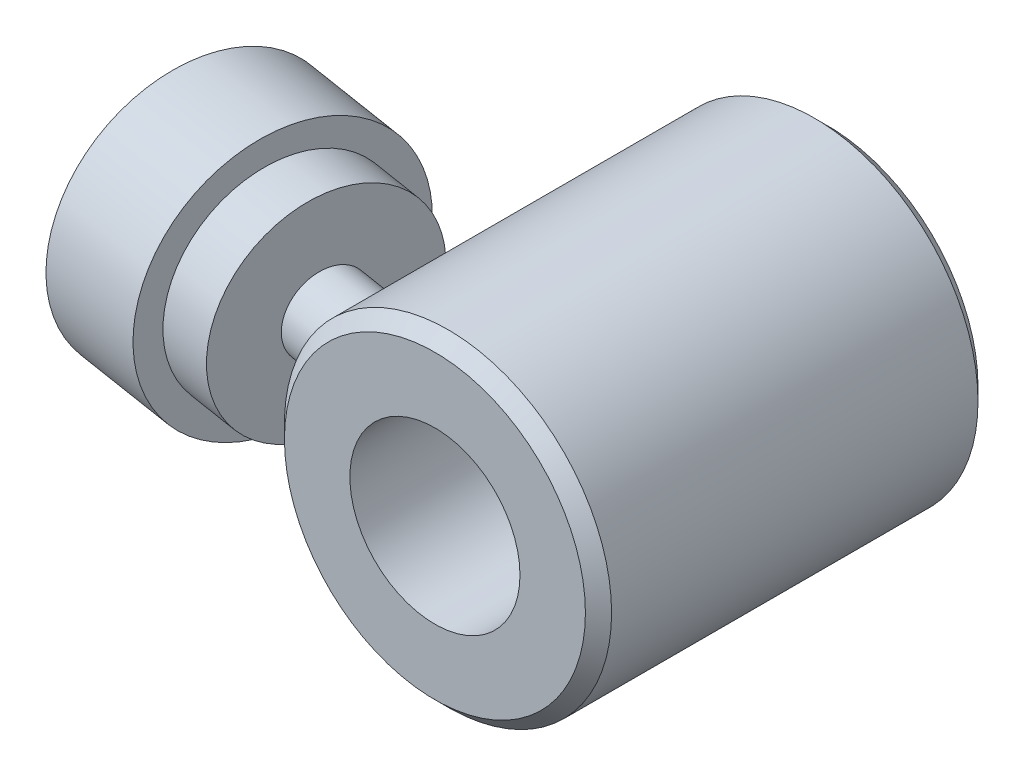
ISO-10303-21;
HEADER;
FILE_DESCRIPTION(('STEP AP214'),'2;1');
FILE_NAME('part.step','',(''),(''),'','','');
FILE_SCHEMA(('AUTOMOTIVE_DESIGN { 1 0 10303 214 1 1 1 1 }'));
ENDSEC;
DATA;
#1=APPLICATION_CONTEXT('core data for automotive mechanical design processes');
#2=APPLICATION_PROTOCOL_DEFINITION('international standard','automotive_design',2000,#1);
#3=PRODUCT_CONTEXT('',#1,'mechanical');
#4=PRODUCT('Part','Part','',(#3));
#5=PRODUCT_RELATED_PRODUCT_CATEGORY('part','',(#4));
#6=PRODUCT_DEFINITION_FORMATION('','',#4);
#7=PRODUCT_DEFINITION_CONTEXT('part definition',#1,'design');
#8=PRODUCT_DEFINITION('design','',#6,#7);
#9=PRODUCT_DEFINITION_SHAPE('','',#8);
#10=(LENGTH_UNIT() NAMED_UNIT(*) SI_UNIT(.MILLI.,.METRE.));
#11=(NAMED_UNIT(*) PLANE_ANGLE_UNIT() SI_UNIT($,.RADIAN.));
#12=(NAMED_UNIT(*) SI_UNIT($,.STERADIAN.) SOLID_ANGLE_UNIT());
#13=UNCERTAINTY_MEASURE_WITH_UNIT(LENGTH_MEASURE(1.E-05),#10,'distance_accuracy_value','');
#14=(GEOMETRIC_REPRESENTATION_CONTEXT(3) GLOBAL_UNCERTAINTY_ASSIGNED_CONTEXT((#13)) GLOBAL_UNIT_ASSIGNED_CONTEXT((#10,
#11,#12)) REPRESENTATION_CONTEXT('',''));
#15=CARTESIAN_POINT('',(0.,0.,0.));
#16=DIRECTION('',(0.,0.,1.));
#17=DIRECTION('',(1.,0.,0.));
#18=AXIS2_PLACEMENT_3D('',#15,#16,#17);
#19=CARTESIAN_POINT('',(-50.0048822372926,0.,38.0396157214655));
#20=DIRECTION('',(0.987688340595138,0.,0.156434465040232));
#21=DIRECTION('',(-0.156434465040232,0.,0.987688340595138));
#22=AXIS2_PLACEMENT_3D('',#19,#20,#21);
#23=CYLINDRICAL_SURFACE('',#22,6.);
#24=CARTESIAN_POINT('',(-25.,0.,48.074790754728));
#25=CARTESIAN_POINT('',(-25.000002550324,0.168460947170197,48.0747943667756));
#26=CARTESIAN_POINT('',(-24.998294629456,0.336872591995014,48.0678767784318));
#27=CARTESIAN_POINT('',(-24.9915151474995,0.672542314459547,48.0402582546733));
#28=CARTESIAN_POINT('',(-24.9864431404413,0.839800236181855,48.019555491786));
#29=CARTESIAN_POINT('',(-24.9730679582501,1.17197778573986,47.9644844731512));
#30=CARTESIAN_POINT('',(-24.9647635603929,1.33689650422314,47.9301110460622));
#31=CARTESIAN_POINT('',(-24.9451478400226,1.66322749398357,47.8479068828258));
#32=CARTESIAN_POINT('',(-24.9338354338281,1.82463847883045,47.8000712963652));
#33=CARTESIAN_POINT('',(-24.9085242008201,2.1426258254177,47.6912959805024));
#34=CARTESIAN_POINT('',(-24.8945274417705,2.299205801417,47.6303663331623));
#35=CARTESIAN_POINT('',(-24.8642196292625,2.60661624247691,47.4957433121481));
#36=CARTESIAN_POINT('',(-24.8479077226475,2.75744456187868,47.4220452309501));
#37=CARTESIAN_POINT('',(-24.8134298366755,3.05216401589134,47.2624026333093));
#38=CARTESIAN_POINT('',(-24.7952646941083,3.19605823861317,47.1764636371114));
#39=CARTESIAN_POINT('',(-24.7575691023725,3.47602260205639,46.9928227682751));
#40=CARTESIAN_POINT('',(-24.73803815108,3.61208983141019,46.89511655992));
#41=CARTESIAN_POINT('',(-24.6981286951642,3.87559389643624,46.6884202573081));
#42=CARTESIAN_POINT('',(-24.6777488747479,4.00301646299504,46.5794122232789));
#43=CARTESIAN_POINT('',(-24.6367383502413,4.24812586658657,46.3509035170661));
#44=CARTESIAN_POINT('',(-24.6161075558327,4.36580907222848,46.2313989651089));
#45=CARTESIAN_POINT('',(-24.5751993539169,4.59049176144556,45.9827694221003));
#46=CARTESIAN_POINT('',(-24.5549218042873,4.69749562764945,45.8536484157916));
#47=CARTESIAN_POINT('',(-24.5152881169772,4.90013419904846,45.5865632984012));
#48=CARTESIAN_POINT('',(-24.4959323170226,4.99576475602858,45.4485959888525));
#49=CARTESIAN_POINT('',(-24.4588705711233,5.17415533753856,45.166018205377));
#50=CARTESIAN_POINT('',(-24.4411520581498,5.25701735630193,45.0214737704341));
#51=CARTESIAN_POINT('',(-24.407691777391,5.41024358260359,44.7256847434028));
#52=CARTESIAN_POINT('',(-24.3919500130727,5.48060776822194,44.5744401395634));
#53=CARTESIAN_POINT('',(-24.3628980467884,5.60834126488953,44.2663585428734));
#54=CARTESIAN_POINT('',(-24.3495875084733,5.66571237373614,44.1095223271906));
#55=CARTESIAN_POINT('',(-24.3257740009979,5.76709926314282,43.7913808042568));
#56=CARTESIAN_POINT('',(-24.3152710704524,5.81111486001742,43.6300754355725));
#57=CARTESIAN_POINT('',(-24.2974946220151,5.88499611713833,43.306557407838));
#58=CARTESIAN_POINT('',(-24.2901763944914,5.91505809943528,43.1443919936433));
#59=CARTESIAN_POINT('',(-24.2787332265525,5.96185304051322,42.8179858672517));
#60=CARTESIAN_POINT('',(-24.2746093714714,5.97858146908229,42.6537444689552));
#61=CARTESIAN_POINT('',(-24.26965147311,5.99867777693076,42.3244443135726));
#62=CARTESIAN_POINT('',(-24.2688163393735,6.00205008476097,42.1593858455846));
#63=CARTESIAN_POINT('',(-24.2704187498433,5.99556038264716,41.8295274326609));
#64=CARTESIAN_POINT('',(-24.2728575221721,5.98569340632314,41.6647276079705));
#65=CARTESIAN_POINT('',(-24.2850551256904,5.93612348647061,41.1690179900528));
#66=CARTESIAN_POINT('',(-24.2997414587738,5.87626032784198,40.8400135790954));
#67=CARTESIAN_POINT('',(-24.3403527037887,5.70567560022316,40.1963692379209));
#68=CARTESIAN_POINT('',(-24.3662802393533,5.59494215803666,39.8817326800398));
#69=CARTESIAN_POINT('',(-24.4277274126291,5.32040712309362,39.2616204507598));
#70=CARTESIAN_POINT('',(-24.4636020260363,5.15458472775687,38.9570742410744));
#71=CARTESIAN_POINT('',(-24.5403887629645,4.77561600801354,38.3794041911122));
#72=CARTESIAN_POINT('',(-24.5813021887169,4.56245743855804,38.1062885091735));
#73=CARTESIAN_POINT('',(-24.6436151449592,4.20799234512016,37.7225365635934));
#74=CARTESIAN_POINT('',(-24.6648467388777,4.08203340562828,37.5973836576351));
#75=CARTESIAN_POINT('',(-24.7068236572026,3.81974881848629,37.3584001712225));
#76=CARTESIAN_POINT('',(-24.727569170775,3.68342729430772,37.2445651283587));
#77=CARTESIAN_POINT('',(-24.7679654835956,3.40120743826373,37.0291535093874));
#78=CARTESIAN_POINT('',(-24.7876159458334,3.25530618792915,36.9275806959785));
#79=CARTESIAN_POINT('',(-24.8252091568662,2.95497442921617,36.7377207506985));
#80=CARTESIAN_POINT('',(-24.8431526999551,2.80054794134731,36.6494274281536));
#81=CARTESIAN_POINT('',(-24.8762519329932,2.48914277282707,36.4895288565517));
#82=CARTESIAN_POINT('',(-24.8914773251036,2.33239542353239,36.4174876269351));
#83=CARTESIAN_POINT('',(-24.9193380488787,2.01302420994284,36.2874608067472));
#84=CARTESIAN_POINT('',(-24.9319745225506,1.85040297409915,36.2294690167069));
#85=CARTESIAN_POINT('',(-24.9542673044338,1.52048362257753,36.1281707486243));
#86=CARTESIAN_POINT('',(-24.963924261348,1.35318653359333,36.0848610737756));
#87=CARTESIAN_POINT('',(-24.9799504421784,1.01522635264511,36.0134348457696));
#88=CARTESIAN_POINT('',(-24.9863198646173,0.844563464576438,35.9853173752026));
#89=CARTESIAN_POINT('',(-24.995256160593,0.512708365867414,35.945978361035));
#90=CARTESIAN_POINT('',(-24.9980474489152,0.3516397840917,35.9337588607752));
#91=CARTESIAN_POINT('',(-25.0005034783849,0.0290243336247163,35.9230036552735));
#92=CARTESIAN_POINT('',(-25.0001683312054,-0.132522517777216,35.9244674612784));
#93=CARTESIAN_POINT('',(-24.9963814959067,-0.454849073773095,35.9410606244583));
#94=CARTESIAN_POINT('',(-24.9929302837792,-0.615628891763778,35.9561878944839));
#95=CARTESIAN_POINT('',(-24.9830117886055,-0.935246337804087,35.9999347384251));
#96=CARTESIAN_POINT('',(-24.9765445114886,-1.09408396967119,36.0285542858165));
#97=CARTESIAN_POINT('',(-24.9609963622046,-1.40432152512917,36.0979996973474));
#98=CARTESIAN_POINT('',(-24.951992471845,-1.55580576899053,36.1384672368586));
#99=CARTESIAN_POINT('',(-24.9315425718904,-1.85490259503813,36.2314778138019));
#100=CARTESIAN_POINT('',(-24.9200957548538,-2.00251387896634,36.2840248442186));
#101=CARTESIAN_POINT('',(-24.8950603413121,-2.29285841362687,36.40068138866));
#102=CARTESIAN_POINT('',(-24.8814722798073,-2.43559287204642,36.4647880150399));
#103=CARTESIAN_POINT('',(-24.8524884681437,-2.71544084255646,36.6040362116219));
#104=CARTESIAN_POINT('',(-24.8370920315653,-2.8525521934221,36.67918197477));
#105=CARTESIAN_POINT('',(-24.8042455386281,-3.12554375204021,36.8430038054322));
#106=CARTESIAN_POINT('',(-24.7867390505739,-3.26117074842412,36.9320910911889));
#107=CARTESIAN_POINT('',(-24.7506313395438,-3.52476580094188,37.1207915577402));
#108=CARTESIAN_POINT('',(-24.7320297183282,-3.65273103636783,37.220408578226));
#109=CARTESIAN_POINT('',(-24.6752843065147,-4.02404407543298,37.533926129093));
#110=CARTESIAN_POINT('',(-24.6361769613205,-4.2549923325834,37.7626037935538));
#111=CARTESIAN_POINT('',(-24.5567451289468,-4.69244504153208,38.269061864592));
#112=CARTESIAN_POINT('',(-24.5165057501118,-4.89639908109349,38.5490627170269));
#113=CARTESIAN_POINT('',(-24.4605588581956,-5.16618584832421,38.9913540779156));
#114=CARTESIAN_POINT('',(-24.4426355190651,-5.25013152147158,39.1426002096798));
#115=CARTESIAN_POINT('',(-24.4087563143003,-5.40545461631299,39.451606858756));
#116=CARTESIAN_POINT('',(-24.3927997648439,-5.47683640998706,39.6093650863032));
#117=CARTESIAN_POINT('',(-24.3629030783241,-5.60835389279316,39.9349332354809));
#118=CARTESIAN_POINT('',(-24.3490328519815,-5.6681137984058,40.1029012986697));
#119=CARTESIAN_POINT('',(-24.3243158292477,-5.77326409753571,40.4434285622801));
#120=CARTESIAN_POINT('',(-24.3134678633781,-5.81866005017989,40.6159859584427));
#121=CARTESIAN_POINT('',(-24.2951546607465,-5.89465785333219,40.9645531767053));
#122=CARTESIAN_POINT('',(-24.2876902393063,-5.92525613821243,41.1405638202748));
#123=CARTESIAN_POINT('',(-24.2764243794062,-5.97124634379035,41.4946045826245));
#124=CARTESIAN_POINT('',(-24.2726213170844,-5.98664500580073,41.6726337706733));
#125=CARTESIAN_POINT('',(-24.2688911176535,-6.00174816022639,42.0241004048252));
#126=CARTESIAN_POINT('',(-24.2688522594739,-6.0019050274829,42.1975172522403));
#127=CARTESIAN_POINT('',(-24.2724069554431,-5.98751338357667,42.5436364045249));
#128=CARTESIAN_POINT('',(-24.2759990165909,-5.97297091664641,42.7163389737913));
#129=CARTESIAN_POINT('',(-24.2867339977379,-5.92917015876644,43.0597571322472));
#130=CARTESIAN_POINT('',(-24.2938768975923,-5.89991195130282,43.2304727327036));
#131=CARTESIAN_POINT('',(-24.311516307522,-5.82679907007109,43.5685714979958));
#132=CARTESIAN_POINT('',(-24.3220127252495,-5.78294479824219,43.7359547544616));
#133=CARTESIAN_POINT('',(-24.3455615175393,-5.68297087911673,44.0593826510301));
#134=CARTESIAN_POINT('',(-24.3584932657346,-5.62741941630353,44.2156120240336));
#135=CARTESIAN_POINT('',(-24.3868006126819,-5.50345317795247,44.5227161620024));
#136=CARTESIAN_POINT('',(-24.4021770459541,-5.43503400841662,44.6735890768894));
#137=CARTESIAN_POINT('',(-24.4349281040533,-5.28584098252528,44.9687909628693));
#138=CARTESIAN_POINT('',(-24.4523019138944,-5.20507216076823,45.1131225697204));
#139=CARTESIAN_POINT('',(-24.4885671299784,-5.03169184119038,45.3943620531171));
#140=CARTESIAN_POINT('',(-24.5074591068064,-4.93907588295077,45.5312671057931));
#141=CARTESIAN_POINT('',(-24.5461002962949,-4.74329522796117,45.7958403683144));
#142=CARTESIAN_POINT('',(-24.5658434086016,-4.64020012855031,45.9235609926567));
#143=CARTESIAN_POINT('',(-24.6057593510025,-4.42365567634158,46.169928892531));
#144=CARTESIAN_POINT('',(-24.6259323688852,-4.31020172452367,46.288572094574));
#145=CARTESIAN_POINT('',(-24.6661464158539,-4.0737692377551,46.5159660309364));
#146=CARTESIAN_POINT('',(-24.6861874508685,-3.9507911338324,46.6247172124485));
#147=CARTESIAN_POINT('',(-24.7255957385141,-3.69614825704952,46.8316597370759));
#148=CARTESIAN_POINT('',(-24.7449629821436,-3.56448336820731,46.9298509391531));
#149=CARTESIAN_POINT('',(-24.7827953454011,-3.29125578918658,47.1165105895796));
#150=CARTESIAN_POINT('',(-24.8012417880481,-3.14957115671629,47.2048043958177));
#151=CARTESIAN_POINT('',(-24.8363905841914,-2.8592101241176,47.3692971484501));
#152=CARTESIAN_POINT('',(-24.8530935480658,-2.7105361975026,47.4455003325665));
#153=CARTESIAN_POINT('',(-24.8843017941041,-2.40722744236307,47.585350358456));
#154=CARTESIAN_POINT('',(-24.8988078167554,-2.25259464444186,47.6490014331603));
#155=CARTESIAN_POINT('',(-24.9252334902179,-1.93845627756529,47.7633657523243));
#156=CARTESIAN_POINT('',(-24.9371535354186,-1.77895145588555,47.8140809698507));
#157=CARTESIAN_POINT('',(-24.9646503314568,-1.35475644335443,47.9299473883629));
#158=CARTESIAN_POINT('',(-24.9778304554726,-1.08684843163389,47.9841981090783));
#159=CARTESIAN_POINT('',(-24.9955031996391,-0.545917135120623,48.0566167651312));
#160=CARTESIAN_POINT('',(-24.9999958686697,-0.272893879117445,48.0747849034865));
#161=CARTESIAN_POINT('',(-25.,0.,48.074790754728));
#162=B_SPLINE_CURVE_WITH_KNOTS('',3,(#24,#25,#26,#27,#28,#29,#30,#31,#32,#33,#34,#35,#36,#37,
#38,#39,#40,#41,#42,#43,#44,#45,#46,#47,#48,#49,#50,#51,#52,#53,#54,#55,#56,#57,#58,#59,#60,#61,
#62,#63,#64,#65,#66,#67,#68,#69,#70,#71,#72,#73,#74,#75,#76,#77,#78,#79,#80,#81,#82,#83,#84,#85,
#86,#87,#88,#89,#90,#91,#92,#93,#94,#95,#96,#97,#98,#99,#100,#101,#102,#103,#104,#105,#106,#107,
#108,#109,#110,#111,#112,#113,#114,#115,#116,#117,#118,#119,#120,#121,#122,#123,#124,#125,#126,
#127,#128,#129,#130,#131,#132,#133,#134,#135,#136,#137,#138,#139,#140,#141,#142,#143,#144,#145,
#146,#147,#148,#149,#150,#151,#152,#153,#154,#155,#156,#157,#158,#159,#160,#161),.UNSPECIFIED.,
.T.,.F.,(4,2,2,2,2,2,2,2,2,2,2,2,2,2,2,2,2,2,2,2,2,2,2,2,2,2,2,2,2,2,2,2,2,2,2,2,2,2,2,2,2,2,2,
2,2,2,2,2,2,2,2,2,2,2,2,2,2,2,2,2,2,2,2,2,2,2,2,2,4),(0.,0.505147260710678,1.0103615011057,
1.5157670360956,2.02135489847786,2.52655485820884,3.03194147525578,3.53710089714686,
4.04244702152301,4.54860795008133,5.0549567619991,5.5610969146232,6.06742111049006,
6.5694638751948,7.07150752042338,7.57348165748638,8.07546269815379,8.57014932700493,
9.06500395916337,9.55969449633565,10.0545706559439,11.0538705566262,12.053403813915,
13.0946270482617,14.1361199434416,14.672059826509,15.2077875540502,15.7436792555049,
16.2793203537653,16.7981889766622,17.3168282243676,17.8353544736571,18.3538494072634,
18.8379148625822,19.3219630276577,19.8059372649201,20.2899105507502,20.7605391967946,
21.2313236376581,21.7019906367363,22.1728368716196,22.6619134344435,23.15116895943,
24.1290417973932,25.1702213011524,25.6914575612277,26.2125120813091,26.748324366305,
27.2839290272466,27.8196626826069,28.3551586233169,28.8747560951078,29.3941400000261,
29.9135209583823,30.4328876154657,30.9312361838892,31.4297552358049,31.9280715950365,
32.4265761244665,32.9219628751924,33.41757064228,33.9131559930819,34.4087479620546,
34.912035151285,35.4151455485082,35.91808599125,36.4209496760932,37.2392542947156,
38.0575543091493),.UNSPECIFIED.);
#163=CARTESIAN_POINT('',(-25.,0.,48.074790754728));
#164=VERTEX_POINT('',#163);
#165=EDGE_CURVE('E187',#164,#164,#162,.T.);
#166=ORIENTED_EDGE('',*,*,#165,.T.);
#167=EDGE_LOOP('',(#166));
#168=FACE_BOUND('',#167,.T.);
#169=CARTESIAN_POINT('',(-36.4241675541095,0.,40.1905896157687));
#170=DIRECTION('',(-0.987688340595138,0.,-0.156434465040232));
#171=DIRECTION('',(0.,-1.,0.));
#172=AXIS2_PLACEMENT_3D('',#169,#170,#171);
#173=CIRCLE('',#172,6.);
#174=CARTESIAN_POINT('',(-36.4241675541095,-6.,40.1905896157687));
#175=VERTEX_POINT('',#174);
#176=EDGE_CURVE('E183',#175,#175,#173,.T.);
#177=ORIENTED_EDGE('',*,*,#176,.F.);
#178=EDGE_LOOP('',(#177));
#179=FACE_BOUND('',#178,.T.);
#180=ADVANCED_FACE('F16',(#168,#179),#23,.T.);
#181=CARTESIAN_POINT('',(-47.3132800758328,5.19615242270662,35.4285282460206));
#182=DIRECTION('',(0.987688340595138,0.,0.156434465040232));
#183=DIRECTION('',(-0.156434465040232,0.,0.987688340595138));
#184=AXIS2_PLACEMENT_3D('',#181,#182,#183);
#185=PLANE('',#184);
#186=DIRECTION('',(0.135476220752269,0.5,-0.855363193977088));
#187=VECTOR('',#186,1.);
#188=CARTESIAN_POINT('',(-48.2518868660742,1.73205080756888,41.3546582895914));
#189=LINE('',#188,#187);
#190=CARTESIAN_POINT('',(-48.2518868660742,1.73205080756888,41.3546582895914));
#191=VERTEX_POINT('',#190);
#192=CARTESIAN_POINT('',(-47.7825834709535,3.46410161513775,38.391593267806));
#193=VERTEX_POINT('',#192);
#194=EDGE_CURVE('E617',#191,#193,#189,.T.);
#195=ORIENTED_EDGE('',*,*,#194,.T.);
#196=DIRECTION('',(-0.135476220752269,0.5,0.855363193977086));
#197=VECTOR('',#196,1.);
#198=CARTESIAN_POINT('',(-47.3132800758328,1.73205080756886,35.4285282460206));
#199=LINE('',#198,#197);
#200=CARTESIAN_POINT('',(-47.3132800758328,1.73205080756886,35.4285282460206));
#201=VERTEX_POINT('',#200);
#202=EDGE_CURVE('E590',#201,#193,#199,.T.);
#203=ORIENTED_EDGE('',*,*,#202,.F.);
#204=DIRECTION('',(0.,1.,0.));
#205=VECTOR('',#204,1.);
#206=CARTESIAN_POINT('',(-47.3132800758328,-1.73205080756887,35.4285282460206));
#207=LINE('',#206,#205);
#208=CARTESIAN_POINT('',(-47.3132800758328,-1.73205080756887,35.4285282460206));
#209=VERTEX_POINT('',#208);
#210=EDGE_CURVE('E572',#209,#201,#207,.T.);
#211=ORIENTED_EDGE('',*,*,#210,.F.);
#212=DIRECTION('',(-0.135476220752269,-0.5,0.855363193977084));
#213=VECTOR('',#212,1.);
#214=CARTESIAN_POINT('',(-47.3132800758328,-1.73205080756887,35.4285282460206));
#215=LINE('',#214,#213);
#216=CARTESIAN_POINT('',(-47.7825834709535,-3.46410161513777,38.391593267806));
#217=VERTEX_POINT('',#216);
#218=EDGE_CURVE('E569',#209,#217,#215,.T.);
#219=ORIENTED_EDGE('',*,*,#218,.T.);
#220=DIRECTION('',(0.135476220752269,-0.5,-0.855363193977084));
#221=VECTOR('',#220,1.);
#222=CARTESIAN_POINT('',(-48.2518868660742,-1.73205080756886,41.3546582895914));
#223=LINE('',#222,#221);
#224=CARTESIAN_POINT('',(-48.2518868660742,-1.73205080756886,41.3546582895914));
#225=VERTEX_POINT('',#224);
#226=EDGE_CURVE('E571',#225,#217,#223,.T.);
#227=ORIENTED_EDGE('',*,*,#226,.F.);
#228=DIRECTION('',(0.,1.,0.));
#229=VECTOR('',#228,1.);
#230=CARTESIAN_POINT('',(-48.2518868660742,-1.73205080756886,41.3546582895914));
#231=LINE('',#230,#229);
#232=EDGE_CURVE('E624',#225,#191,#231,.T.);
#233=ORIENTED_EDGE('',*,*,#232,.T.);
#234=EDGE_LOOP('',(#195,#203,#211,#219,#227,#233));
#235=FACE_BOUND('',#234,.T.);
#236=ADVANCED_FACE('F18',(#235),#185,.F.);
#237=CARTESIAN_POINT('',(-47.3132800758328,-1.73205080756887,35.4285282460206));
#238=DIRECTION('',(-0.156434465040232,0.,0.987688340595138));
#239=DIRECTION('',(0.,-1.,0.));
#240=AXIS2_PLACEMENT_3D('',#237,#238,#239);
#241=PLANE('',#240);
#242=DIRECTION('',(-0.987688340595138,0.,-0.156434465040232));
#243=VECTOR('',#242,1.);
#244=CARTESIAN_POINT('',(-47.3132800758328,1.73205080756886,35.4285282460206));
#245=LINE('',#244,#243);
#246=CARTESIAN_POINT('',(-49.7825009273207,1.73205080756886,35.03744208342));
#247=VERTEX_POINT('',#246);
#248=EDGE_CURVE('E609',#201,#247,#245,.T.);
#249=ORIENTED_EDGE('',*,*,#248,.T.);
#250=DIRECTION('',(0.,1.,0.));
#251=VECTOR('',#250,1.);
#252=CARTESIAN_POINT('',(-49.7825009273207,-1.73205080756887,35.03744208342));
#253=LINE('',#252,#251);
#254=CARTESIAN_POINT('',(-49.7825009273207,-1.73205080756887,35.03744208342));
#255=VERTEX_POINT('',#254);
#256=EDGE_CURVE('E593',#255,#247,#253,.T.);
#257=ORIENTED_EDGE('',*,*,#256,.F.);
#258=DIRECTION('',(-0.987688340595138,0.,-0.156434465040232));
#259=VECTOR('',#258,1.);
#260=CARTESIAN_POINT('',(-47.3132800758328,-1.73205080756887,35.4285282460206));
#261=LINE('',#260,#259);
#262=EDGE_CURVE('E576',#209,#255,#261,.T.);
#263=ORIENTED_EDGE('',*,*,#262,.F.);
#264=ORIENTED_EDGE('',*,*,#210,.T.);
#265=EDGE_LOOP('',(#249,#257,#263,#264));
#266=FACE_BOUND('',#265,.T.);
#267=ADVANCED_FACE('F652',(#266),#241,.T.);
#268=CARTESIAN_POINT('',(-47.3132800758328,-1.73205080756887,35.4285282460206));
#269=DIRECTION('',(0.0782172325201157,-0.866025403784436,-0.493844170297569));
#270=DIRECTION('',(0.135476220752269,0.5,-0.855363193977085));
#271=AXIS2_PLACEMENT_3D('',#268,#269,#270);
#272=PLANE('',#271);
#273=ORIENTED_EDGE('',*,*,#262,.T.);
#274=DIRECTION('',(-0.135476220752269,-0.5,0.855363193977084));
#275=VECTOR('',#274,1.);
#276=CARTESIAN_POINT('',(-49.7825009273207,-1.73205080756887,35.03744208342));
#277=LINE('',#276,#275);
#278=CARTESIAN_POINT('',(-50.2518043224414,-3.46410161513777,38.0005071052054));
#279=VERTEX_POINT('',#278);
#280=EDGE_CURVE('E567',#255,#279,#277,.T.);
#281=ORIENTED_EDGE('',*,*,#280,.T.);
#282=DIRECTION('',(-0.987688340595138,0.,-0.156434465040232));
#283=VECTOR('',#282,1.);
#284=CARTESIAN_POINT('',(-47.7825834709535,-3.46410161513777,38.391593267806));
#285=LINE('',#284,#283);
#286=EDGE_CURVE('E575',#217,#279,#285,.T.);
#287=ORIENTED_EDGE('',*,*,#286,.F.);
#288=ORIENTED_EDGE('',*,*,#218,.F.);
#289=EDGE_LOOP('',(#273,#281,#287,#288));
#290=FACE_BOUND('',#289,.T.);
#291=ADVANCED_FACE('F655',(#290),#272,.F.);
#292=CARTESIAN_POINT('',(-48.2518868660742,-1.73205080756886,41.3546582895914));
#293=DIRECTION('',(0.0782172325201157,0.866025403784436,-0.493844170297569));
#294=DIRECTION('',(-0.135476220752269,0.5,0.855363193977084));
#295=AXIS2_PLACEMENT_3D('',#292,#293,#294);
#296=PLANE('',#295);
#297=ORIENTED_EDGE('',*,*,#286,.T.);
#298=DIRECTION('',(0.135476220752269,-0.5,-0.855363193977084));
#299=VECTOR('',#298,1.);
#300=CARTESIAN_POINT('',(-50.7211077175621,-1.73205080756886,40.9635721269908));
#301=LINE('',#300,#299);
#302=CARTESIAN_POINT('',(-50.7211077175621,-1.73205080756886,40.9635721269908));
#303=VERTEX_POINT('',#302);
#304=EDGE_CURVE('E564',#303,#279,#301,.T.);
#305=ORIENTED_EDGE('',*,*,#304,.F.);
#306=DIRECTION('',(-0.987688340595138,0.,-0.156434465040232));
#307=VECTOR('',#306,1.);
#308=CARTESIAN_POINT('',(-48.2518868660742,-1.73205080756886,41.3546582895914));
#309=LINE('',#308,#307);
#310=EDGE_CURVE('E96',#225,#303,#309,.T.);
#311=ORIENTED_EDGE('',*,*,#310,.F.);
#312=ORIENTED_EDGE('',*,*,#226,.T.);
#313=EDGE_LOOP('',(#297,#305,#311,#312));
#314=FACE_BOUND('',#313,.T.);
#315=ADVANCED_FACE('F658',(#314),#296,.T.);
#316=CARTESIAN_POINT('',(-48.2518868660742,-1.73205080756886,41.3546582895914));
#317=DIRECTION('',(-0.156434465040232,0.,0.987688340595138));
#318=DIRECTION('',(0.,-1.,0.));
#319=AXIS2_PLACEMENT_3D('',#316,#317,#318);
#320=PLANE('',#319);
#321=ORIENTED_EDGE('',*,*,#310,.T.);
#322=DIRECTION('',(0.,1.,0.));
#323=VECTOR('',#322,1.);
#324=CARTESIAN_POINT('',(-50.7211077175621,-1.73205080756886,40.9635721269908));
#325=LINE('',#324,#323);
#326=CARTESIAN_POINT('',(-50.7211077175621,1.73205080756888,40.9635721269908));
#327=VERTEX_POINT('',#326);
#328=EDGE_CURVE('E193',#303,#327,#325,.T.);
#329=ORIENTED_EDGE('',*,*,#328,.T.);
#330=DIRECTION('',(-0.987688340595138,0.,-0.156434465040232));
#331=VECTOR('',#330,1.);
#332=CARTESIAN_POINT('',(-48.2518868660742,1.73205080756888,41.3546582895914));
#333=LINE('',#332,#331);
#334=EDGE_CURVE('E101',#191,#327,#333,.T.);
#335=ORIENTED_EDGE('',*,*,#334,.F.);
#336=ORIENTED_EDGE('',*,*,#232,.F.);
#337=EDGE_LOOP('',(#321,#329,#335,#336));
#338=FACE_BOUND('',#337,.T.);
#339=ADVANCED_FACE('F660',(#338),#320,.F.);
#340=CARTESIAN_POINT('',(-48.2518868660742,1.73205080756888,41.3546582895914));
#341=DIRECTION('',(-0.0782172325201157,0.86602540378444,0.493844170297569));
#342=DIRECTION('',(-0.135476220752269,-0.5,0.855363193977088));
#343=AXIS2_PLACEMENT_3D('',#340,#341,#342);
#344=PLANE('',#343);
#345=ORIENTED_EDGE('',*,*,#334,.T.);
#346=DIRECTION('',(0.135476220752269,0.5,-0.855363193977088));
#347=VECTOR('',#346,1.);
#348=CARTESIAN_POINT('',(-50.7211077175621,1.73205080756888,40.9635721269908));
#349=LINE('',#348,#347);
#350=CARTESIAN_POINT('',(-50.2518043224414,3.46410161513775,38.0005071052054));
#351=VERTEX_POINT('',#350);
#352=EDGE_CURVE('E20',#327,#351,#349,.T.);
#353=ORIENTED_EDGE('',*,*,#352,.T.);
#354=DIRECTION('',(-0.987688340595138,0.,-0.156434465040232));
#355=VECTOR('',#354,1.);
#356=CARTESIAN_POINT('',(-47.7825834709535,3.46410161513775,38.391593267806));
#357=LINE('',#356,#355);
#358=EDGE_CURVE('E610',#193,#351,#357,.T.);
#359=ORIENTED_EDGE('',*,*,#358,.F.);
#360=ORIENTED_EDGE('',*,*,#194,.F.);
#361=EDGE_LOOP('',(#345,#353,#359,#360));
#362=FACE_BOUND('',#361,.T.);
#363=ADVANCED_FACE('F644',(#362),#344,.F.);
#364=CARTESIAN_POINT('',(-47.3132800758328,1.73205080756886,35.4285282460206));
#365=DIRECTION('',(-0.0782172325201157,-0.866025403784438,0.493844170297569));
#366=DIRECTION('',(0.135476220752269,-0.5,-0.855363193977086));
#367=AXIS2_PLACEMENT_3D('',#364,#365,#366);
#368=PLANE('',#367);
#369=ORIENTED_EDGE('',*,*,#202,.T.);
#370=ORIENTED_EDGE('',*,*,#358,.T.);
#371=DIRECTION('',(-0.135476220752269,0.5,0.855363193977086));
#372=VECTOR('',#371,1.);
#373=CARTESIAN_POINT('',(-49.7825009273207,1.73205080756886,35.03744208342));
#374=LINE('',#373,#372);
#375=EDGE_CURVE('E596',#247,#351,#374,.T.);
#376=ORIENTED_EDGE('',*,*,#375,.F.);
#377=ORIENTED_EDGE('',*,*,#248,.F.);
#378=EDGE_LOOP('',(#369,#370,#376,#377));
#379=FACE_BOUND('',#378,.T.);
#380=ADVANCED_FACE('F647',(#379),#368,.T.);
#381=CARTESIAN_POINT('',(-50.2518043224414,0.,38.0005071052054));
#382=DIRECTION('',(0.987688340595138,0.,0.156434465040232));
#383=DIRECTION('',(-0.156434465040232,0.,0.987688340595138));
#384=AXIS2_PLACEMENT_3D('',#381,#382,#383);
#385=PLANE('',#384);
#386=ORIENTED_EDGE('',*,*,#375,.T.);
#387=ORIENTED_EDGE('',*,*,#352,.F.);
#388=ORIENTED_EDGE('',*,*,#328,.F.);
#389=ORIENTED_EDGE('',*,*,#304,.T.);
#390=ORIENTED_EDGE('',*,*,#280,.F.);
#391=ORIENTED_EDGE('',*,*,#256,.T.);
#392=EDGE_LOOP('',(#386,#387,#388,#389,#390,#391));
#393=FACE_BOUND('',#392,.T.);
#394=CARTESIAN_POINT('',(-50.2518043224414,0.,38.0005071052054));
#395=DIRECTION('',(0.987688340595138,0.,0.156434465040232));
#396=DIRECTION('',(-0.156434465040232,0.,0.987688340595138));
#397=AXIS2_PLACEMENT_3D('',#394,#395,#396);
#398=CIRCLE('',#397,5.);
#399=CARTESIAN_POINT('',(-51.0339766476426,0.,42.9389488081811));
#400=VERTEX_POINT('',#399);
#401=EDGE_CURVE('E607',#400,#400,#398,.T.);
#402=ORIENTED_EDGE('',*,*,#401,.F.);
#403=EDGE_LOOP('',(#402));
#404=FACE_BOUND('',#403,.T.);
#405=ADVANCED_FACE('F542',(#393,#404),#385,.F.);
#406=CARTESIAN_POINT('',(-49.2641159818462,0.,38.1569415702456));
#407=DIRECTION('',(0.987688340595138,0.,0.156434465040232));
#408=DIRECTION('',(-0.156434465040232,0.,0.987688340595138));
#409=AXIS2_PLACEMENT_3D('',#406,#407,#408);
#410=CONICAL_SURFACE('',#409,6.,0.785398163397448);
#411=ORIENTED_EDGE('',*,*,#401,.T.);
#412=EDGE_LOOP('',(#411));
#413=FACE_BOUND('',#412,.T.);
#414=CARTESIAN_POINT('',(-49.2641159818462,0.,38.1569415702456));
#415=DIRECTION('',(0.987688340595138,0.,0.156434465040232));
#416=DIRECTION('',(-0.156434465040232,0.,0.987688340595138));
#417=AXIS2_PLACEMENT_3D('',#414,#415,#416);
#418=CIRCLE('',#417,6.);
#419=CARTESIAN_POINT('',(-50.2027227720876,0.,44.0830716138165));
#420=VERTEX_POINT('',#419);
#421=EDGE_CURVE('E225',#420,#420,#418,.T.);
#422=ORIENTED_EDGE('',*,*,#421,.F.);
#423=EDGE_LOOP('',(#422));
#424=FACE_BOUND('',#423,.T.);
#425=ADVANCED_FACE('F536',(#413,#424),#410,.T.);
#426=CARTESIAN_POINT('',(0.,-21.5,41.443375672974));
#427=DIRECTION('',(0.,-1.,0.));
#428=DIRECTION('',(1.,0.,0.));
#429=AXIS2_PLACEMENT_3D('',#426,#427,#428);
#430=PLANE('',#429);
#431=DIRECTION('',(-0.866025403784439,0.,0.5));
#432=VECTOR('',#431,1.);
#433=CARTESIAN_POINT('',(1.25,-21.5,40.721687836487));
#434=LINE('',#433,#432);
#435=CARTESIAN_POINT('',(1.25,-21.5,40.721687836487));
#436=VERTEX_POINT('',#435);
#437=CARTESIAN_POINT('',(0.,-21.5,41.443375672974));
#438=VERTEX_POINT('',#437);
#439=EDGE_CURVE('E150',#436,#438,#434,.T.);
#440=ORIENTED_EDGE('',*,*,#439,.T.);
#441=DIRECTION('',(-0.866025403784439,0.,-0.5));
#442=VECTOR('',#441,1.);
#443=CARTESIAN_POINT('',(0.,-21.5,41.443375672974));
#444=LINE('',#443,#442);
#445=CARTESIAN_POINT('',(-1.25,-21.5,40.721687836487));
#446=VERTEX_POINT('',#445);
#447=EDGE_CURVE('E176',#438,#446,#444,.T.);
#448=ORIENTED_EDGE('',*,*,#447,.T.);
#449=DIRECTION('',(0.,0.,-1.));
#450=VECTOR('',#449,1.);
#451=CARTESIAN_POINT('',(-1.25,-21.5,40.721687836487));
#452=LINE('',#451,#450);
#453=CARTESIAN_POINT('',(-1.25,-21.5,39.278312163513));
#454=VERTEX_POINT('',#453);
#455=EDGE_CURVE('E172',#446,#454,#452,.T.);
#456=ORIENTED_EDGE('',*,*,#455,.T.);
#457=DIRECTION('',(0.866025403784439,0.,-0.5));
#458=VECTOR('',#457,1.);
#459=CARTESIAN_POINT('',(-1.25,-21.5,39.278312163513));
#460=LINE('',#459,#458);
#461=CARTESIAN_POINT('',(0.,-21.5,38.556624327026));
#462=VERTEX_POINT('',#461);
#463=EDGE_CURVE('E169',#454,#462,#460,.T.);
#464=ORIENTED_EDGE('',*,*,#463,.T.);
#465=DIRECTION('',(0.866025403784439,0.,0.5));
#466=VECTOR('',#465,1.);
#467=CARTESIAN_POINT('',(0.,-21.5,38.556624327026));
#468=LINE('',#467,#466);
#469=CARTESIAN_POINT('',(1.25,-21.5,39.278312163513));
#470=VERTEX_POINT('',#469);
#471=EDGE_CURVE('E124',#462,#470,#468,.T.);
#472=ORIENTED_EDGE('',*,*,#471,.T.);
#473=DIRECTION('',(0.,0.,1.));
#474=VECTOR('',#473,1.);
#475=CARTESIAN_POINT('',(1.25,-21.5,39.278312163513));
#476=LINE('',#475,#474);
#477=EDGE_CURVE('E162',#470,#436,#476,.T.);
#478=ORIENTED_EDGE('',*,*,#477,.T.);
#479=EDGE_LOOP('',(#440,#448,#456,#464,#472,#478));
#480=FACE_BOUND('',#479,.T.);
#481=ADVANCED_FACE('F291',(#480),#430,.T.);
#482=CARTESIAN_POINT('',(0.,0.,0.));
#483=DIRECTION('',(0.,0.,1.));
#484=DIRECTION('',(1.,0.,0.));
#485=AXIS2_PLACEMENT_3D('',#482,#483,#484);
#486=CYLINDRICAL_SURFACE('',#485,6.5);
#487=CARTESIAN_POINT('',(0.,0.,1.));
#488=DIRECTION('',(0.,0.,-1.));
#489=DIRECTION('',(-1.,0.,0.));
#490=AXIS2_PLACEMENT_3D('',#487,#488,#489);
#491=CIRCLE('',#490,6.5);
#492=CARTESIAN_POINT('',(-6.5,0.,1.));
#493=VERTEX_POINT('',#492);
#494=EDGE_CURVE('E161',#493,#493,#491,.T.);
#495=ORIENTED_EDGE('',*,*,#494,.T.);
#496=EDGE_LOOP('',(#495));
#497=FACE_BOUND('',#496,.T.);
#498=CARTESIAN_POINT('',(0.,0.,8.));
#499=DIRECTION('',(0.,0.,1.));
#500=DIRECTION('',(1.,0.,0.));
#501=AXIS2_PLACEMENT_3D('',#498,#499,#500);
#502=CIRCLE('',#501,6.5);
#503=CARTESIAN_POINT('',(6.5,0.,8.));
#504=VERTEX_POINT('',#503);
#505=EDGE_CURVE('E254',#504,#504,#502,.T.);
#506=ORIENTED_EDGE('',*,*,#505,.T.);
#507=EDGE_LOOP('',(#506));
#508=FACE_BOUND('',#507,.T.);
#509=ADVANCED_FACE('F288',(#497,#508),#486,.F.);
#510=CARTESIAN_POINT('',(0.,-21.5,41.443375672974));
#511=DIRECTION('',(-0.5,0.,0.866025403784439));
#512=DIRECTION('',(-0.866025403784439,0.,-0.5));
#513=AXIS2_PLACEMENT_3D('',#510,#511,#512);
#514=PLANE('',#513);
#515=DIRECTION('',(-0.866025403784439,0.,-0.5));
#516=VECTOR('',#515,1.);
#517=CARTESIAN_POINT('',(0.,-24.5,41.443375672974));
#518=LINE('',#517,#516);
#519=CARTESIAN_POINT('',(0.,-24.5,41.443375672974));
#520=VERTEX_POINT('',#519);
#521=CARTESIAN_POINT('',(-1.25,-24.5,40.721687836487));
#522=VERTEX_POINT('',#521);
#523=EDGE_CURVE('E156',#520,#522,#518,.T.);
#524=ORIENTED_EDGE('',*,*,#523,.T.);
#525=DIRECTION('',(0.,-1.,0.));
#526=VECTOR('',#525,1.);
#527=CARTESIAN_POINT('',(-1.25,-21.5,40.721687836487));
#528=LINE('',#527,#526);
#529=EDGE_CURVE('E36',#446,#522,#528,.T.);
#530=ORIENTED_EDGE('',*,*,#529,.F.);
#531=ORIENTED_EDGE('',*,*,#447,.F.);
#532=DIRECTION('',(0.,-1.,0.));
#533=VECTOR('',#532,1.);
#534=CARTESIAN_POINT('',(0.,-21.5,41.443375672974));
#535=LINE('',#534,#533);
#536=EDGE_CURVE('E166',#438,#520,#535,.T.);
#537=ORIENTED_EDGE('',*,*,#536,.T.);
#538=EDGE_LOOP('',(#524,#530,#531,#537));
#539=FACE_BOUND('',#538,.T.);
#540=ADVANCED_FACE('F290',(#539),#514,.F.);
#541=CARTESIAN_POINT('',(-1.25,-21.5,40.721687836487));
#542=DIRECTION('',(-1.,0.,0.));
#543=DIRECTION('',(0.,-1.,0.));
#544=AXIS2_PLACEMENT_3D('',#541,#542,#543);
#545=PLANE('',#544);
#546=DIRECTION('',(0.,0.,-1.));
#547=VECTOR('',#546,1.);
#548=CARTESIAN_POINT('',(-1.25,-24.5,40.721687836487));
#549=LINE('',#548,#547);
#550=CARTESIAN_POINT('',(-1.25,-24.5,39.278312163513));
#551=VERTEX_POINT('',#550);
#552=EDGE_CURVE('E138',#522,#551,#549,.T.);
#553=ORIENTED_EDGE('',*,*,#552,.T.);
#554=DIRECTION('',(0.,-1.,0.));
#555=VECTOR('',#554,1.);
#556=CARTESIAN_POINT('',(-1.25,-21.5,39.278312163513));
#557=LINE('',#556,#555);
#558=EDGE_CURVE('E129',#454,#551,#557,.T.);
#559=ORIENTED_EDGE('',*,*,#558,.F.);
#560=ORIENTED_EDGE('',*,*,#455,.F.);
#561=ORIENTED_EDGE('',*,*,#529,.T.);
#562=EDGE_LOOP('',(#553,#559,#560,#561));
#563=FACE_BOUND('',#562,.T.);
#564=ADVANCED_FACE('F511',(#563),#545,.F.);
#565=CARTESIAN_POINT('',(-1.25,-21.5,39.278312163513));
#566=DIRECTION('',(-0.5,0.,-0.866025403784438));
#567=DIRECTION('',(0.866025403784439,0.,-0.5));
#568=AXIS2_PLACEMENT_3D('',#565,#566,#567);
#569=PLANE('',#568);
#570=DIRECTION('',(0.866025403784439,0.,-0.5));
#571=VECTOR('',#570,1.);
#572=CARTESIAN_POINT('',(-1.25,-24.5,39.278312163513));
#573=LINE('',#572,#571);
#574=CARTESIAN_POINT('',(0.,-24.5,38.556624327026));
#575=VERTEX_POINT('',#574);
#576=EDGE_CURVE('E133',#551,#575,#573,.T.);
#577=ORIENTED_EDGE('',*,*,#576,.T.);
#578=DIRECTION('',(0.,-1.,0.));
#579=VECTOR('',#578,1.);
#580=CARTESIAN_POINT('',(0.,-21.5,38.556624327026));
#581=LINE('',#580,#579);
#582=EDGE_CURVE('E117',#462,#575,#581,.T.);
#583=ORIENTED_EDGE('',*,*,#582,.F.);
#584=ORIENTED_EDGE('',*,*,#463,.F.);
#585=ORIENTED_EDGE('',*,*,#558,.T.);
#586=EDGE_LOOP('',(#577,#583,#584,#585));
#587=FACE_BOUND('',#586,.T.);
#588=ADVANCED_FACE('F134',(#587),#569,.F.);
#589=CARTESIAN_POINT('',(0.,-21.5,38.556624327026));
#590=DIRECTION('',(0.5,0.,-0.866025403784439));
#591=DIRECTION('',(0.866025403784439,0.,0.5));
#592=AXIS2_PLACEMENT_3D('',#589,#590,#591);
#593=PLANE('',#592);
#594=DIRECTION('',(0.866025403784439,0.,0.5));
#595=VECTOR('',#594,1.);
#596=CARTESIAN_POINT('',(0.,-24.5,38.556624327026));
#597=LINE('',#596,#595);
#598=CARTESIAN_POINT('',(1.25,-24.5,39.278312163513));
#599=VERTEX_POINT('',#598);
#600=EDGE_CURVE('E121',#575,#599,#597,.T.);
#601=ORIENTED_EDGE('',*,*,#600,.T.);
#602=DIRECTION('',(0.,-1.,0.));
#603=VECTOR('',#602,1.);
#604=CARTESIAN_POINT('',(1.25,-21.5,39.278312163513));
#605=LINE('',#604,#603);
#606=EDGE_CURVE('E130',#470,#599,#605,.T.);
#607=ORIENTED_EDGE('',*,*,#606,.F.);
#608=ORIENTED_EDGE('',*,*,#471,.F.);
#609=ORIENTED_EDGE('',*,*,#582,.T.);
#610=EDGE_LOOP('',(#601,#607,#608,#609));
#611=FACE_BOUND('',#610,.T.);
#612=ADVANCED_FACE('F119',(#611),#593,.F.);
#613=CARTESIAN_POINT('',(1.25,-21.5,39.278312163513));
#614=DIRECTION('',(1.,0.,0.));
#615=DIRECTION('',(0.,1.,0.));
#616=AXIS2_PLACEMENT_3D('',#613,#614,#615);
#617=PLANE('',#616);
#618=DIRECTION('',(0.,0.,1.));
#619=VECTOR('',#618,1.);
#620=CARTESIAN_POINT('',(1.25,-24.5,39.278312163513));
#621=LINE('',#620,#619);
#622=CARTESIAN_POINT('',(1.25,-24.5,40.721687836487));
#623=VERTEX_POINT('',#622);
#624=EDGE_CURVE('E143',#599,#623,#621,.T.);
#625=ORIENTED_EDGE('',*,*,#624,.T.);
#626=DIRECTION('',(0.,-1.,0.));
#627=VECTOR('',#626,1.);
#628=CARTESIAN_POINT('',(1.25,-21.5,40.721687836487));
#629=LINE('',#628,#627);
#630=EDGE_CURVE('E547',#436,#623,#629,.T.);
#631=ORIENTED_EDGE('',*,*,#630,.F.);
#632=ORIENTED_EDGE('',*,*,#477,.F.);
#633=ORIENTED_EDGE('',*,*,#606,.T.);
#634=EDGE_LOOP('',(#625,#631,#632,#633));
#635=FACE_BOUND('',#634,.T.);
#636=ADVANCED_FACE('F488',(#635),#617,.F.);
#637=CARTESIAN_POINT('',(1.25,-21.5,40.721687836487));
#638=DIRECTION('',(0.5,0.,0.866025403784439));
#639=DIRECTION('',(-0.866025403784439,0.,0.5));
#640=AXIS2_PLACEMENT_3D('',#637,#638,#639);
#641=PLANE('',#640);
#642=DIRECTION('',(-0.866025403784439,0.,0.5));
#643=VECTOR('',#642,1.);
#644=CARTESIAN_POINT('',(1.25,-24.5,40.721687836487));
#645=LINE('',#644,#643);
#646=EDGE_CURVE('E107',#623,#520,#645,.T.);
#647=ORIENTED_EDGE('',*,*,#646,.T.);
#648=ORIENTED_EDGE('',*,*,#536,.F.);
#649=ORIENTED_EDGE('',*,*,#439,.F.);
#650=ORIENTED_EDGE('',*,*,#630,.T.);
#651=EDGE_LOOP('',(#647,#648,#649,#650));
#652=FACE_BOUND('',#651,.T.);
#653=ADVANCED_FACE('F467',(#652),#641,.F.);
#654=CARTESIAN_POINT('',(0.,0.,0.));
#655=DIRECTION('',(0.,0.,-1.));
#656=DIRECTION('',(-1.,0.,0.));
#657=AXIS2_PLACEMENT_3D('',#654,#655,#656);
#658=CONICAL_SURFACE('',#657,7.5,0.785398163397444);
#659=ORIENTED_EDGE('',*,*,#494,.F.);
#660=EDGE_LOOP('',(#659));
#661=FACE_BOUND('',#660,.T.);
#662=CARTESIAN_POINT('',(0.,0.,0.));
#663=DIRECTION('',(0.,0.,-1.));
#664=DIRECTION('',(-1.,0.,0.));
#665=AXIS2_PLACEMENT_3D('',#662,#663,#664);
#666=CIRCLE('',#665,7.5);
#667=CARTESIAN_POINT('',(-7.5,0.,0.));
#668=VERTEX_POINT('',#667);
#669=EDGE_CURVE('E600',#668,#668,#666,.F.);
#670=ORIENTED_EDGE('',*,*,#669,.F.);
#671=EDGE_LOOP('',(#670));
#672=FACE_BOUND('',#671,.T.);
#673=ADVANCED_FACE('F423',(#661,#672),#658,.F.);
#674=CARTESIAN_POINT('',(13.,0.,8.));
#675=DIRECTION('',(0.,0.,-1.));
#676=DIRECTION('',(-1.,0.,0.));
#677=AXIS2_PLACEMENT_3D('',#674,#675,#676);
#678=PLANE('',#677);
#679=ORIENTED_EDGE('',*,*,#505,.F.);
#680=EDGE_LOOP('',(#679));
#681=FACE_BOUND('',#680,.T.);
#682=CARTESIAN_POINT('',(0.,0.,8.));
#683=DIRECTION('',(0.,0.,1.));
#684=DIRECTION('',(1.,0.,0.));
#685=AXIS2_PLACEMENT_3D('',#682,#683,#684);
#686=CIRCLE('',#685,13.);
#687=CARTESIAN_POINT('',(13.,0.,8.));
#688=VERTEX_POINT('',#687);
#689=EDGE_CURVE('E584',#688,#688,#686,.T.);
#690=ORIENTED_EDGE('',*,*,#689,.T.);
#691=EDGE_LOOP('',(#690));
#692=FACE_BOUND('',#691,.T.);
#693=ADVANCED_FACE('F267',(#681,#692),#678,.F.);
#694=CARTESIAN_POINT('',(0.,-24.5,40.));
#695=DIRECTION('',(0.,-1.,0.));
#696=DIRECTION('',(1.,0.,0.));
#697=AXIS2_PLACEMENT_3D('',#694,#695,#696);
#698=PLANE('',#697);
#699=ORIENTED_EDGE('',*,*,#646,.F.);
#700=ORIENTED_EDGE('',*,*,#624,.F.);
#701=ORIENTED_EDGE('',*,*,#600,.F.);
#702=ORIENTED_EDGE('',*,*,#576,.F.);
#703=ORIENTED_EDGE('',*,*,#552,.F.);
#704=ORIENTED_EDGE('',*,*,#523,.F.);
#705=EDGE_LOOP('',(#699,#700,#701,#702,#703,#704));
#706=FACE_BOUND('',#705,.T.);
#707=CARTESIAN_POINT('',(0.,-24.5,40.));
#708=DIRECTION('',(0.,-1.,0.));
#709=DIRECTION('',(1.,0.,0.));
#710=AXIS2_PLACEMENT_3D('',#707,#708,#709);
#711=CIRCLE('',#710,2.5);
#712=CARTESIAN_POINT('',(2.5,-24.5,40.));
#713=VERTEX_POINT('',#712);
#714=EDGE_CURVE('E216',#713,#713,#711,.T.);
#715=ORIENTED_EDGE('',*,*,#714,.T.);
#716=EDGE_LOOP('',(#715));
#717=FACE_BOUND('',#716,.T.);
#718=ADVANCED_FACE('F140',(#706,#717),#698,.T.);
#719=CARTESIAN_POINT('',(0.,0.,0.));
#720=DIRECTION('',(0.,0.,1.));
#721=DIRECTION('',(1.,0.,0.));
#722=AXIS2_PLACEMENT_3D('',#719,#720,#721);
#723=CYLINDRICAL_SURFACE('',#722,13.);
#724=CARTESIAN_POINT('',(0.,0.,60.));
#725=DIRECTION('',(0.,0.,1.));
#726=DIRECTION('',(1.,0.,0.));
#727=AXIS2_PLACEMENT_3D('',#724,#725,#726);
#728=CIRCLE('',#727,13.);
#729=CARTESIAN_POINT('',(13.,0.,60.));
#730=VERTEX_POINT('',#729);
#731=EDGE_CURVE('E282',#730,#730,#728,.T.);
#732=ORIENTED_EDGE('',*,*,#731,.T.);
#733=EDGE_LOOP('',(#732));
#734=FACE_BOUND('',#733,.T.);
#735=CARTESIAN_POINT('',(-13.,0.,18.1661946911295));
#736=CARTESIAN_POINT('',(-12.9999992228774,0.0700735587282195,18.1661917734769));
#737=CARTESIAN_POINT('',(-12.9994274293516,0.140193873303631,18.1602998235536));
#738=CARTESIAN_POINT('',(-12.9972011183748,0.278499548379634,18.1368732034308));
#739=CARTESIAN_POINT('',(-12.9955453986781,0.346682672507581,18.1193256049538));
#740=CARTESIAN_POINT('',(-12.9913375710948,0.479097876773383,18.0730715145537));
#741=CARTESIAN_POINT('',(-12.9887858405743,0.543331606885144,18.0443697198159));
#742=CARTESIAN_POINT('',(-12.9830728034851,0.666031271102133,17.9766102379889));
#743=CARTESIAN_POINT('',(-12.9799116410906,0.724498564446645,17.9375549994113));
#744=CARTESIAN_POINT('',(-12.9733355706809,0.834013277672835,17.8501909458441));
#745=CARTESIAN_POINT('',(-12.9699207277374,0.885062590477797,17.8018844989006));
#746=CARTESIAN_POINT('',(-12.9632200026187,0.978324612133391,17.6973765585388));
#747=CARTESIAN_POINT('',(-12.9599341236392,1.02053710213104,17.6411748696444));
#748=CARTESIAN_POINT('',(-12.9538569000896,1.09498524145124,17.5224390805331));
#749=CARTESIAN_POINT('',(-12.9510658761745,1.12721443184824,17.4599009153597));
#750=CARTESIAN_POINT('',(-12.9462898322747,1.18080795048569,17.3303046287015));
#751=CARTESIAN_POINT('',(-12.9443048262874,1.20217209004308,17.2632464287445));
#752=CARTESIAN_POINT('',(-12.941346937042,1.23360967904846,17.1261074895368));
#753=CARTESIAN_POINT('',(-12.9403799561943,1.24361731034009,17.0560115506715));
#754=CARTESIAN_POINT('',(-12.9395777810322,1.25193624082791,16.9151241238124));
#755=CARTESIAN_POINT('',(-12.9397426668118,1.25024671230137,16.8443325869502));
#756=CARTESIAN_POINT('',(-12.9411870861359,1.23520598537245,16.7030899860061));
#757=CARTESIAN_POINT('',(-12.9424809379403,1.22170498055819,16.6326550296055));
#758=CARTESIAN_POINT('',(-12.9460512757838,1.18326899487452,16.4950008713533));
#759=CARTESIAN_POINT('',(-12.9483278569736,1.15833290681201,16.4277819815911));
#760=CARTESIAN_POINT('',(-12.9536413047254,1.09732522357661,16.2975698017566));
#761=CARTESIAN_POINT('',(-12.9566875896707,1.06111428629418,16.2346421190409));
#762=CARTESIAN_POINT('',(-12.9631776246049,0.978637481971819,16.1157783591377));
#763=CARTESIAN_POINT('',(-12.9666213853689,0.932371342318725,16.0598424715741));
#764=CARTESIAN_POINT('',(-12.9735069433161,0.831074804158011,15.9567004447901));
#765=CARTESIAN_POINT('',(-12.976948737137,0.776055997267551,15.9094829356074));
#766=CARTESIAN_POINT('',(-12.9834337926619,0.658704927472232,15.825192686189));
#767=CARTESIAN_POINT('',(-12.9864771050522,0.596373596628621,15.7881186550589));
#768=CARTESIAN_POINT('',(-12.99174457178,0.467581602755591,15.7260573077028));
#769=CARTESIAN_POINT('',(-12.9939849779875,0.40123899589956,15.7008265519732));
#770=CARTESIAN_POINT('',(-12.997473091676,0.265174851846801,15.6621756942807));
#771=CARTESIAN_POINT('',(-12.9987209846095,0.195453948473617,15.6487533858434));
#772=CARTESIAN_POINT('',(-13.0000568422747,0.0566473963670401,15.6344055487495));
#773=CARTESIAN_POINT('',(-13.0001754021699,-0.0124040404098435,15.6331503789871));
#774=CARTESIAN_POINT('',(-12.9993191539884,-0.149715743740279,15.6423211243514));
#775=CARTESIAN_POINT('',(-12.9983444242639,-0.217976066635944,15.6527462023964));
#776=CARTESIAN_POINT('',(-12.9954263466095,-0.351129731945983,15.6847602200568));
#777=CARTESIAN_POINT('',(-12.9934920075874,-0.416048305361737,15.70624539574));
#778=CARTESIAN_POINT('',(-12.9888719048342,-0.54143042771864,15.7596080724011));
#779=CARTESIAN_POINT('',(-12.986186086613,-0.601893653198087,15.7914863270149));
#780=CARTESIAN_POINT('',(-12.9803025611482,-0.717753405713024,15.8652497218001));
#781=CARTESIAN_POINT('',(-12.9770971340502,-0.773049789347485,15.9072914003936));
#782=CARTESIAN_POINT('',(-12.9705527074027,-0.876031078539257,15.9998339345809));
#783=CARTESIAN_POINT('',(-12.9672136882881,-0.923714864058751,16.0503360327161));
#784=CARTESIAN_POINT('',(-12.9606656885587,-1.01150417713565,16.1598874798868));
#785=CARTESIAN_POINT('',(-12.957462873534,-1.05136315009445,16.2191348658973));
#786=CARTESIAN_POINT('',(-12.9516431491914,-1.12078442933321,16.3434115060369));
#787=CARTESIAN_POINT('',(-12.9490263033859,-1.15034561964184,16.4084413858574));
#788=CARTESIAN_POINT('',(-12.9446321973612,-1.19879247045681,16.5436585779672));
#789=CARTESIAN_POINT('',(-12.9428701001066,-1.21748642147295,16.6139151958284));
#790=CARTESIAN_POINT('',(-12.9404612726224,-1.24283003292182,16.756589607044));
#791=CARTESIAN_POINT('',(-12.939814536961,-1.24947975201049,16.8290073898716));
#792=CARTESIAN_POINT('',(-12.9397198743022,-1.25045997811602,16.9737220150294));
#793=CARTESIAN_POINT('',(-12.9402684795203,-1.24482612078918,17.0460185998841));
#794=CARTESIAN_POINT('',(-12.942503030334,-1.22137317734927,17.1885906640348));
#795=CARTESIAN_POINT('',(-12.9441888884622,-1.20355502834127,17.2588662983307));
#796=CARTESIAN_POINT('',(-12.9484768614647,-1.1565001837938,17.3943466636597));
#797=CARTESIAN_POINT('',(-12.9510657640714,-1.12742751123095,17.45960878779));
#798=CARTESIAN_POINT('',(-12.9568700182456,-1.05863367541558,17.5842224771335));
#799=CARTESIAN_POINT('',(-12.9600853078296,-1.01891356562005,17.6435746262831));
#800=CARTESIAN_POINT('',(-12.9667340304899,-0.930455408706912,17.7539886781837));
#801=CARTESIAN_POINT('',(-12.9701645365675,-0.881826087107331,17.8051379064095));
#802=CARTESIAN_POINT('',(-12.9768888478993,-0.776613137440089,17.8985095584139));
#803=CARTESIAN_POINT('',(-12.9801826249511,-0.72002787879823,17.9407301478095));
#804=CARTESIAN_POINT('',(-12.9862485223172,-0.600749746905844,18.0148992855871));
#805=CARTESIAN_POINT('',(-12.9890224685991,-0.53807947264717,18.0468840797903));
#806=CARTESIAN_POINT('',(-12.9937486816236,-0.408283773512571,18.099871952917));
#807=CARTESIAN_POINT('',(-12.9957018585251,-0.341163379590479,18.1208872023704));
#808=CARTESIAN_POINT('',(-12.9980769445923,-0.228055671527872,18.1461253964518));
#809=CARTESIAN_POINT('',(-12.9987947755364,-0.182781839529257,18.1536417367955));
#810=CARTESIAN_POINT('',(-12.999756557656,-0.0916786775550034,18.1636773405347));
#811=CARTESIAN_POINT('',(-13.0000005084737,-0.0458493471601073,18.1661966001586));
#812=CARTESIAN_POINT('',(-13.,0.,18.1661946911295));
#813=B_SPLINE_CURVE_WITH_KNOTS('',3,(#735,#736,#737,#738,#739,#740,#741,#742,#743,#744,#745,
#746,#747,#748,#749,#750,#751,#752,#753,#754,#755,#756,#757,#758,#759,#760,#761,#762,#763,#764,
#765,#766,#767,#768,#769,#770,#771,#772,#773,#774,#775,#776,#777,#778,#779,#780,#781,#782,#783,
#784,#785,#786,#787,#788,#789,#790,#791,#792,#793,#794,#795,#796,#797,#798,#799,#800,#801,#802,
#803,#804,#805,#806,#807,#808,#809,#810,#811,#812),.UNSPECIFIED.,.T.,.F.,(4,2,2,2,2,2,2,2,2,2,2,
2,2,2,2,2,2,2,2,2,2,2,2,2,2,2,2,2,2,2,2,2,2,2,2,2,2,2,4),(0.,0.210053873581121,
0.420341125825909,0.630539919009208,0.840689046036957,1.05078445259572,1.26088506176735,
1.47112131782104,1.68136122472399,1.8928134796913,2.10428069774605,2.31846950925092,
2.53267906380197,2.7496487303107,2.96662427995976,3.18331483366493,3.39997779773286,
3.61196778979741,3.8239181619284,4.03010962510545,4.23628631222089,4.44056301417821,
4.64485453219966,4.85251922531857,5.06021444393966,5.27366382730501,5.48713633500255,
5.70426860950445,5.92139982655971,6.13790196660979,6.35438745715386,6.56782996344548,
6.78125135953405,6.99222343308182,7.20323880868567,7.4134984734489,7.62352436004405,
7.76096315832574,7.8984020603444),.UNSPECIFIED.);
#814=CARTESIAN_POINT('',(-13.,0.,18.1661946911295));
#815=VERTEX_POINT('',#814);
#816=EDGE_CURVE('E27',#815,#815,#813,.T.);
#817=ORIENTED_EDGE('',*,*,#816,.T.);
#818=EDGE_LOOP('',(#817));
#819=FACE_BOUND('',#818,.T.);
#820=ORIENTED_EDGE('',*,*,#689,.F.);
#821=EDGE_LOOP('',(#820));
#822=FACE_BOUND('',#821,.T.);
#823=ADVANCED_FACE('F238',(#734,#819,#822),#723,.F.);
#824=CARTESIAN_POINT('',(0.,0.,60.));
#825=DIRECTION('',(0.,0.,1.));
#826=DIRECTION('',(1.,0.,0.));
#827=AXIS2_PLACEMENT_3D('',#824,#825,#826);
#828=PLANE('',#827);
#829=CARTESIAN_POINT('',(0.,0.,60.));
#830=DIRECTION('',(0.,0.,1.));
#831=DIRECTION('',(1.,0.,0.));
#832=AXIS2_PLACEMENT_3D('',#829,#830,#831);
#833=CIRCLE('',#832,23.);
#834=CARTESIAN_POINT('',(23.,0.,60.));
#835=VERTEX_POINT('',#834);
#836=EDGE_CURVE('E598',#835,#835,#833,.T.);
#837=ORIENTED_EDGE('',*,*,#836,.T.);
#838=EDGE_LOOP('',(#837));
#839=FACE_BOUND('',#838,.T.);
#840=ORIENTED_EDGE('',*,*,#731,.F.);
#841=EDGE_LOOP('',(#840));
#842=FACE_BOUND('',#841,.T.);
#843=ADVANCED_FACE('F286',(#839,#842),#828,.T.);
#844=CARTESIAN_POINT('',(25.,0.,0.));
#845=DIRECTION('',(0.,0.,-1.));
#846=DIRECTION('',(-1.,0.,0.));
#847=AXIS2_PLACEMENT_3D('',#844,#845,#846);
#848=PLANE('',#847);
#849=ORIENTED_EDGE('',*,*,#669,.T.);
#850=EDGE_LOOP('',(#849));
#851=FACE_BOUND('',#850,.T.);
#852=CARTESIAN_POINT('',(0.,0.,0.));
#853=DIRECTION('',(0.,0.,-1.));
#854=DIRECTION('',(-1.,0.,0.));
#855=AXIS2_PLACEMENT_3D('',#852,#853,#854);
#856=CIRCLE('',#855,23.);
#857=CARTESIAN_POINT('',(-23.,0.,0.));
#858=VERTEX_POINT('',#857);
#859=EDGE_CURVE('E599',#858,#858,#856,.T.);
#860=ORIENTED_EDGE('',*,*,#859,.T.);
#861=EDGE_LOOP('',(#860));
#862=FACE_BOUND('',#861,.T.);
#863=ADVANCED_FACE('F241',(#851,#862),#848,.T.);
#864=CARTESIAN_POINT('',(0.,-10.,40.));
#865=DIRECTION('',(0.,-1.,0.));
#866=DIRECTION('',(0.,0.,-1.));
#867=AXIS2_PLACEMENT_3D('',#864,#865,#866);
#868=CYLINDRICAL_SURFACE('',#867,2.5);
#869=CARTESIAN_POINT('',(0.,-25.,37.5));
#870=CARTESIAN_POINT('',(-0.140050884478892,-24.9999983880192,37.5000060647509));
#871=CARTESIAN_POINT('',(-0.280194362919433,-24.9988106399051,37.5118081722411));
#872=CARTESIAN_POINT('',(-0.556595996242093,-24.9941866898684,37.5587109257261));
#873=CARTESIAN_POINT('',(-0.69284969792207,-24.9907480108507,37.5938372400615));
#874=CARTESIAN_POINT('',(-0.957429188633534,-24.9820103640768,37.6863556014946));
#875=CARTESIAN_POINT('',(-1.08575971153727,-24.9767125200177,37.7437342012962));
#876=CARTESIAN_POINT('',(-1.33094040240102,-24.9648489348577,37.8791022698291));
#877=CARTESIAN_POINT('',(-1.4477928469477,-24.9582834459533,37.9570876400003));
#878=CARTESIAN_POINT('',(-1.66714887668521,-24.9445936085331,38.1317567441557));
#879=CARTESIAN_POINT('',(-1.76960536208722,-24.9374675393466,38.2284994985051));
#880=CARTESIAN_POINT('',(-1.95685630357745,-24.9234739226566,38.4378113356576));
#881=CARTESIAN_POINT('',(-2.04164994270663,-24.9166063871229,38.5503811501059));
#882=CARTESIAN_POINT('',(-2.19133492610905,-24.9038897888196,38.788446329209));
#883=CARTESIAN_POINT('',(-2.25618366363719,-24.8980429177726,38.9139686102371));
#884=CARTESIAN_POINT('',(-2.36386596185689,-24.8880509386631,39.1741889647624));
#885=CARTESIAN_POINT('',(-2.40670006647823,-24.8839057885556,39.3088868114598));
#886=CARTESIAN_POINT('',(-2.46899760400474,-24.8778021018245,39.583154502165));
#887=CARTESIAN_POINT('',(-2.48853913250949,-24.8758362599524,39.7227064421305));
#888=CARTESIAN_POINT('',(-2.5039382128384,-24.8742910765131,40.0031221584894));
#889=CARTESIAN_POINT('',(-2.49979638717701,-24.8747116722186,40.1439859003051));
#890=CARTESIAN_POINT('',(-2.4680107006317,-24.8778851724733,40.4224882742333));
#891=CARTESIAN_POINT('',(-2.44045211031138,-24.8806296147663,40.5601367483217));
#892=CARTESIAN_POINT('',(-2.36274786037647,-24.8881283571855,40.8288449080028));
#893=CARTESIAN_POINT('',(-2.31260189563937,-24.8928826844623,40.9599045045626));
#894=CARTESIAN_POINT('',(-2.19105223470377,-24.9038752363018,41.2119839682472));
#895=CARTESIAN_POINT('',(-2.11961070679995,-24.9101160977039,41.3329854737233));
#896=CARTESIAN_POINT('',(-1.95752506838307,-24.923376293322,41.5613130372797));
#897=CARTESIAN_POINT('',(-1.86688039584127,-24.9303956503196,41.6686386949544));
#898=CARTESIAN_POINT('',(-1.66848528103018,-24.9444596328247,41.8670634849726));
#899=CARTESIAN_POINT('',(-1.56066119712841,-24.9515042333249,41.958089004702));
#900=CARTESIAN_POINT('',(-1.33122370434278,-24.964795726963,42.120759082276));
#901=CARTESIAN_POINT('',(-1.209610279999,-24.9710426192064,42.1924036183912));
#902=CARTESIAN_POINT('',(-0.955995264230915,-24.9820368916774,42.3142750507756));
#903=CARTESIAN_POINT('',(-0.823991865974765,-24.9867840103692,42.3644982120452));
#904=CARTESIAN_POINT('',(-0.553368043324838,-24.9942411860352,42.4420472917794));
#905=CARTESIAN_POINT('',(-0.414747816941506,-24.9969513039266,42.4693738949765));
#906=CARTESIAN_POINT('',(-0.135462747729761,-25.0000212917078,42.5002607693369));
#907=CARTESIAN_POINT('',(0.00519075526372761,-25.0003912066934,42.5039226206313));
#908=CARTESIAN_POINT('',(0.285109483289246,-24.9987660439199,42.4876428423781));
#909=CARTESIAN_POINT('',(0.42437472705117,-24.9967709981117,42.4677015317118));
#910=CARTESIAN_POINT('',(0.697270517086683,-24.9906465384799,42.404865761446));
#911=CARTESIAN_POINT('',(0.830912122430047,-24.986521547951,42.362018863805));
#912=CARTESIAN_POINT('',(1.08911080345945,-24.9765999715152,42.2546370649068));
#913=CARTESIAN_POINT('',(1.21366767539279,-24.9708033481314,42.1901016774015));
#914=CARTESIAN_POINT('',(1.45062045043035,-24.9581618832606,42.0409229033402));
#915=CARTESIAN_POINT('',(1.56297414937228,-24.951313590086,41.9562127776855));
#916=CARTESIAN_POINT('',(1.77190405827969,-24.937348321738,41.7691848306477));
#917=CARTESIAN_POINT('',(1.86847987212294,-24.9302313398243,41.6668665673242));
#918=CARTESIAN_POINT('',(2.04346527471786,-24.9165006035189,41.4470835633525));
#919=CARTESIAN_POINT('',(2.12180819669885,-24.9098887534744,41.3295656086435));
#920=CARTESIAN_POINT('',(2.25764564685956,-24.8979458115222,41.0829815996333));
#921=CARTESIAN_POINT('',(2.3151404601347,-24.892614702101,40.953915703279));
#922=CARTESIAN_POINT('',(2.40753802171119,-24.8838486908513,40.6881281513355));
#923=CARTESIAN_POINT('',(2.44248043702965,-24.8804104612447,40.5514203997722));
#924=CARTESIAN_POINT('',(2.48891001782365,-24.8758091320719,40.2740420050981));
#925=CARTESIAN_POINT('',(2.50039785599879,-24.8746459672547,40.1333714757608));
#926=CARTESIAN_POINT('',(2.49958284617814,-24.8747278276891,39.8527232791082));
#927=CARTESIAN_POINT('',(2.48738472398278,-24.8759622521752,39.712745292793));
#928=CARTESIAN_POINT('',(2.43976363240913,-24.8806775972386,39.4368377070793));
#929=CARTESIAN_POINT('',(2.4043406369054,-24.884158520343,39.3009081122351));
#930=CARTESIAN_POINT('',(2.31130421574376,-24.8929717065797,39.0369566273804));
#931=CARTESIAN_POINT('',(2.25369386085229,-24.898303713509,38.9089336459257));
#932=CARTESIAN_POINT('',(2.11792888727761,-24.910218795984,38.6643577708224));
#933=CARTESIAN_POINT('',(2.03977438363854,-24.9168018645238,38.5478048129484));
#934=CARTESIAN_POINT('',(1.86474639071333,-24.9305121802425,38.3289408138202));
#935=CARTESIAN_POINT('',(1.76779487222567,-24.9376416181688,38.2266923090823));
#936=CARTESIAN_POINT('',(1.55807924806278,-24.9516213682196,38.0398694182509));
#937=CARTESIAN_POINT('',(1.44531136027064,-24.9584716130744,37.9552992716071));
#938=CARTESIAN_POINT('',(1.20685358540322,-24.9711390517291,37.8060663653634));
#939=CARTESIAN_POINT('',(1.0811318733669,-24.9769536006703,37.741454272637));
#940=CARTESIAN_POINT('',(0.820645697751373,-24.9868657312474,37.6343439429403));
#941=CARTESIAN_POINT('',(0.685891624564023,-24.9909652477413,37.5918207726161));
#942=CARTESIAN_POINT('',(0.458645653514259,-24.9959553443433,37.540698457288));
#943=CARTESIAN_POINT('',(0.367606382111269,-24.9974650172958,37.5254573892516));
#944=CARTESIAN_POINT('',(0.18439145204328,-24.9994878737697,37.5051061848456));
#945=CARTESIAN_POINT('',(0.0922157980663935,-25.0000010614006,37.4999960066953));
#946=CARTESIAN_POINT('',(0.,-25.,37.5));
#947=B_SPLINE_CURVE_WITH_KNOTS('',3,(#869,#870,#871,#872,#873,#874,#875,#876,#877,#878,#879,
#880,#881,#882,#883,#884,#885,#886,#887,#888,#889,#890,#891,#892,#893,#894,#895,#896,#897,#898,
#899,#900,#901,#902,#903,#904,#905,#906,#907,#908,#909,#910,#911,#912,#913,#914,#915,#916,#917,
#918,#919,#920,#921,#922,#923,#924,#925,#926,#927,#928,#929,#930,#931,#932,#933,#934,#935,#936,
#937,#938,#939,#940,#941,#942,#943,#944,#945,#946),.UNSPECIFIED.,.T.,.F.,(4,2,2,2,2,2,2,2,2,2,2,
2,2,2,2,2,2,2,2,2,2,2,2,2,2,2,2,2,2,2,2,2,2,2,2,2,2,2,4),(0.,0.419815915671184,
0.840094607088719,1.2601197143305,1.68006134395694,2.10134642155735,2.52265098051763,
2.94484938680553,3.36703736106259,3.78780580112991,4.20856318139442,4.62779493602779,
5.04703235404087,5.46701903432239,5.88701800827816,6.30886835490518,6.7307191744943,
7.15264351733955,7.574555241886,7.99465471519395,8.4147485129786,8.83397338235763,
9.25320765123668,9.67384851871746,10.0944999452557,10.516666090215,10.9388264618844,
11.3602422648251,11.7816459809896,12.2011907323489,12.620735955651,13.04022313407,
13.459707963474,13.8809729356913,14.302338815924,14.7247657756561,15.1467148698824,
15.4231416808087,15.6995673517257),.UNSPECIFIED.);
#948=CARTESIAN_POINT('',(0.,-25.,37.5));
#949=VERTEX_POINT('',#948);
#950=EDGE_CURVE('E10',#949,#949,#947,.T.);
#951=ORIENTED_EDGE('',*,*,#950,.F.);
#952=EDGE_LOOP('',(#951));
#953=FACE_BOUND('',#952,.T.);
#954=ORIENTED_EDGE('',*,*,#714,.F.);
#955=EDGE_LOOP('',(#954));
#956=FACE_BOUND('',#955,.T.);
#957=ADVANCED_FACE('F239',(#953,#956),#868,.F.);
#958=CARTESIAN_POINT('',(-37.2997519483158,0.,13.0519106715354));
#959=DIRECTION('',(-0.987688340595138,0.,-0.156434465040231));
#960=DIRECTION('',(-0.156434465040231,0.,0.987688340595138));
#961=AXIS2_PLACEMENT_3D('',#958,#959,#960);
#962=CYLINDRICAL_SURFACE('',#961,1.25);
#963=CARTESIAN_POINT('',(-25.,0.,16.265581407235));
#964=CARTESIAN_POINT('',(-24.9999995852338,0.0698742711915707,16.265578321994));
#965=CARTESIAN_POINT('',(-24.9997039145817,0.139798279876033,16.2596760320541));
#966=CARTESIAN_POINT('',(-24.9985528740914,0.277715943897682,16.236215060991));
#967=CARTESIAN_POINT('',(-24.9976968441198,0.345707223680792,16.2186426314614));
#968=CARTESIAN_POINT('',(-24.9955220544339,0.477739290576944,16.172350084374));
#969=CARTESIAN_POINT('',(-24.9942035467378,0.54178220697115,16.1436360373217));
#970=CARTESIAN_POINT('',(-24.9912521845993,0.664126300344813,16.0758932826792));
#971=CARTESIAN_POINT('',(-24.9896194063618,0.722428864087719,16.036867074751));
#972=CARTESIAN_POINT('',(-24.9862189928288,0.831783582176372,15.949537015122));
#973=CARTESIAN_POINT('',(-24.9844511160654,0.882822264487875,15.9012163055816));
#974=CARTESIAN_POINT('',(-24.9809804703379,0.976114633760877,15.7967279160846));
#975=CARTESIAN_POINT('',(-24.9792777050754,1.0183678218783,15.7405597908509));
#976=CARTESIAN_POINT('',(-24.9761172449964,1.09315188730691,15.6216526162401));
#977=CARTESIAN_POINT('',(-24.9746609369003,1.12562850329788,15.5588794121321));
#978=CARTESIAN_POINT('',(-24.9721656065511,1.17969538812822,15.4288018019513));
#979=CARTESIAN_POINT('',(-24.9711266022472,1.20128518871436,15.3614972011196));
#980=CARTESIAN_POINT('',(-24.969571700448,1.23318664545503,15.2236197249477));
#981=CARTESIAN_POINT('',(-24.9690606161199,1.24339459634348,15.1530228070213));
#982=CARTESIAN_POINT('',(-24.9686327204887,1.25195792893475,15.0111121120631));
#983=CARTESIAN_POINT('',(-24.9687159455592,1.25031258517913,14.9397982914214));
#984=CARTESIAN_POINT('',(-24.9694691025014,1.23518014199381,14.7977042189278));
#985=CARTESIAN_POINT('',(-24.9701450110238,1.22157240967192,14.7269368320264));
#986=CARTESIAN_POINT('',(-24.9720140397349,1.18274648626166,14.5886667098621));
#987=CARTESIAN_POINT('',(-24.973207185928,1.15752771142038,14.5211641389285));
#988=CARTESIAN_POINT('',(-24.9759829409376,1.09600410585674,14.3909888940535));
#989=CARTESIAN_POINT('',(-24.9775675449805,1.05964224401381,14.3283431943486));
#990=CARTESIAN_POINT('',(-24.9809418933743,0.976858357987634,14.210096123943));
#991=CARTESIAN_POINT('',(-24.9827316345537,0.930436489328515,14.1544946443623));
#992=CARTESIAN_POINT('',(-24.9862986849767,0.829111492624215,14.0523251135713));
#993=CARTESIAN_POINT('',(-24.9880760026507,0.774262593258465,14.0057033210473));
#994=CARTESIAN_POINT('',(-24.991423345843,0.657395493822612,13.9225198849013));
#995=CARTESIAN_POINT('',(-24.9929933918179,0.595378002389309,13.8859572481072));
#996=CARTESIAN_POINT('',(-24.995717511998,0.467064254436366,13.8246112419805));
#997=CARTESIAN_POINT('',(-24.9968782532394,0.400859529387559,13.7996367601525));
#998=CARTESIAN_POINT('',(-24.9986858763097,0.265149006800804,13.7613751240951));
#999=CARTESIAN_POINT('',(-24.9993328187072,0.195643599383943,13.7480865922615));
#1000=CARTESIAN_POINT('',(-25.000030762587,0.0566320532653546,13.7337713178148));
#1001=CARTESIAN_POINT('',(-25.0000921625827,-0.0128520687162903,13.7325306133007));
#1002=CARTESIAN_POINT('',(-24.9996392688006,-0.15102834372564,13.7417932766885));
#1003=CARTESIAN_POINT('',(-24.9991250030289,-0.219720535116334,13.7522960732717));
#1004=CARTESIAN_POINT('',(-24.9975837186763,-0.353966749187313,13.7846075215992));
#1005=CARTESIAN_POINT('',(-24.9965596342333,-0.419536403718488,13.8063515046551));
#1006=CARTESIAN_POINT('',(-24.994114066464,-0.546146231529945,13.860420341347));
#1007=CARTESIAN_POINT('',(-24.992692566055,-0.607186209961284,13.8927456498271));
#1008=CARTESIAN_POINT('',(-24.9895914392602,-0.723710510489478,13.9673830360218));
#1009=CARTESIAN_POINT('',(-24.9879092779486,-0.779130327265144,14.0097956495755));
#1010=CARTESIAN_POINT('',(-24.9844820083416,-0.882227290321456,14.1031657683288));
#1011=CARTESIAN_POINT('',(-24.9827368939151,-0.929903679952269,14.1541241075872));
#1012=CARTESIAN_POINT('',(-24.9793400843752,-1.01711066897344,14.2641714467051));
#1013=CARTESIAN_POINT('',(-24.9776907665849,-1.05647101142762,14.3233954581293));
#1014=CARTESIAN_POINT('',(-24.9747042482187,-1.12486625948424,14.4475403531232));
#1015=CARTESIAN_POINT('',(-24.9733670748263,-1.153900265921,14.5124617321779));
#1016=CARTESIAN_POINT('',(-24.9711358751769,-1.20122718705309,14.6471989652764));
#1017=CARTESIAN_POINT('',(-24.9702486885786,-1.21935505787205,14.7170729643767));
#1018=CARTESIAN_POINT('',(-24.969049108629,-1.24367874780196,14.8588746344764));
#1019=CARTESIAN_POINT('',(-24.9687367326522,-1.24987420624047,14.9308023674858));
#1020=CARTESIAN_POINT('',(-24.968724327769,-1.25012236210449,15.0749034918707));
#1021=CARTESIAN_POINT('',(-24.9690261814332,-1.24413772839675,15.1470769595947));
#1022=CARTESIAN_POINT('',(-24.9702141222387,-1.22006151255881,15.2893723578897));
#1023=CARTESIAN_POINT('',(-24.971100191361,-1.20197030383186,15.3594943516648));
#1024=CARTESIAN_POINT('',(-24.9733485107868,-1.15430725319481,15.4951557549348));
#1025=CARTESIAN_POINT('',(-24.9747073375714,-1.12481778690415,15.560724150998));
#1026=CARTESIAN_POINT('',(-24.9777477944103,-1.05514237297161,15.6858971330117));
#1027=CARTESIAN_POINT('',(-24.9794293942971,-1.01495742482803,15.7455022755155));
#1028=CARTESIAN_POINT('',(-24.9829031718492,-0.925487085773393,15.8563976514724));
#1029=CARTESIAN_POINT('',(-24.9846940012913,-0.876301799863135,15.9077687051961));
#1030=CARTESIAN_POINT('',(-24.9881980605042,-0.76992387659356,16.0014506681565));
#1031=CARTESIAN_POINT('',(-24.9899112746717,-0.712729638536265,16.0437597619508));
#1032=CARTESIAN_POINT('',(-24.9930507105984,-0.592456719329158,16.1177672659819));
#1033=CARTESIAN_POINT('',(-24.9944790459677,-0.529426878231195,16.1495450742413));
#1034=CARTESIAN_POINT('',(-24.9969013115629,-0.398953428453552,16.2019848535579));
#1035=CARTESIAN_POINT('',(-24.9978957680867,-0.33151528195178,16.2226602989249));
#1036=CARTESIAN_POINT('',(-24.9990720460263,-0.21970683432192,16.2468294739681));
#1037=CARTESIAN_POINT('',(-24.9994185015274,-0.176069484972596,16.2538524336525));
#1038=CARTESIAN_POINT('',(-24.9998826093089,-0.0882947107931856,16.2632293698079));
#1039=CARTESIAN_POINT('',(-25.0000002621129,-0.0441572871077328,16.2655833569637));
#1040=CARTESIAN_POINT('',(-25.,0.,16.265581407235));
#1041=B_SPLINE_CURVE_WITH_KNOTS('',3,(#963,#964,#965,#966,#967,#968,#969,#970,#971,#972,#973,
#974,#975,#976,#977,#978,#979,#980,#981,#982,#983,#984,#985,#986,#987,#988,#989,#990,#991,#992,
#993,#994,#995,#996,#997,#998,#999,#1000,#1001,#1002,#1003,#1004,#1005,#1006,#1007,#1008,#1009,
#1010,#1011,#1012,#1013,#1014,#1015,#1016,#1017,#1018,#1019,#1020,#1021,#1022,#1023,#1024,#1025,
#1026,#1027,#1028,#1029,#1030,#1031,#1032,#1033,#1034,#1035,#1036,#1037,#1038,#1039,#1040),
.UNSPECIFIED.,.T.,.F.,(4,2,2,2,2,2,2,2,2,2,2,2,2,2,2,2,2,2,2,2,2,2,2,2,2,2,2,2,2,2,2,2,2,2,2,2,
2,2,4),(0.,0.209461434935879,0.419170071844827,0.628764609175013,0.838308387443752,
1.04823587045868,1.25817526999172,1.4692592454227,1.68035229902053,1.89335338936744,
2.10636751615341,2.32155471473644,2.53675273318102,2.75307108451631,2.96938609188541,
3.18436328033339,3.39931923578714,3.61059172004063,3.82183929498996,4.02932823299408,
4.23680707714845,4.44310539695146,4.6494125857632,4.85786912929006,5.06634602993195,
5.27874786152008,5.49116818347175,5.70672712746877,5.92229258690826,6.13851973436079,
6.35474021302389,6.569426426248,6.78409258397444,6.99650215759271,7.208954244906,
7.41976609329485,7.63032150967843,7.76269169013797,7.89506156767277),.UNSPECIFIED.);
#1042=CARTESIAN_POINT('',(-25.,0.,16.265581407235));
#1043=VERTEX_POINT('',#1042);
#1044=EDGE_CURVE('E246',#1043,#1043,#1041,.T.);
#1045=ORIENTED_EDGE('',*,*,#1044,.T.);
#1046=EDGE_LOOP('',(#1045));
#1047=FACE_BOUND('',#1046,.T.);
#1048=ORIENTED_EDGE('',*,*,#816,.F.);
#1049=EDGE_LOOP('',(#1048));
#1050=FACE_BOUND('',#1049,.T.);
#1051=ADVANCED_FACE('F261',(#1047,#1050),#962,.F.);
#1052=CARTESIAN_POINT('',(0.,0.,60.));
#1053=DIRECTION('',(0.,0.,-1.));
#1054=DIRECTION('',(-1.,0.,0.));
#1055=AXIS2_PLACEMENT_3D('',#1052,#1053,#1054);
#1056=CONICAL_SURFACE('',#1055,23.,0.785398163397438);
#1057=CARTESIAN_POINT('',(0.,0.,58.));
#1058=DIRECTION('',(0.,0.,1.));
#1059=DIRECTION('',(1.,0.,0.));
#1060=AXIS2_PLACEMENT_3D('',#1057,#1058,#1059);
#1061=CIRCLE('',#1060,25.);
#1062=CARTESIAN_POINT('',(25.,0.,58.));
#1063=VERTEX_POINT('',#1062);
#1064=EDGE_CURVE('E280',#1063,#1063,#1061,.F.);
#1065=ORIENTED_EDGE('',*,*,#1064,.F.);
#1066=EDGE_LOOP('',(#1065));
#1067=FACE_BOUND('',#1066,.T.);
#1068=ORIENTED_EDGE('',*,*,#836,.F.);
#1069=EDGE_LOOP('',(#1068));
#1070=FACE_BOUND('',#1069,.T.);
#1071=ADVANCED_FACE('F265',(#1067,#1070),#1056,.T.);
#1072=CARTESIAN_POINT('',(0.,0.,2.));
#1073=DIRECTION('',(0.,0.,1.));
#1074=DIRECTION('',(1.,0.,0.));
#1075=AXIS2_PLACEMENT_3D('',#1072,#1073,#1074);
#1076=CONICAL_SURFACE('',#1075,25.,0.785398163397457);
#1077=ORIENTED_EDGE('',*,*,#859,.F.);
#1078=EDGE_LOOP('',(#1077));
#1079=FACE_BOUND('',#1078,.T.);
#1080=CARTESIAN_POINT('',(0.,0.,2.));
#1081=DIRECTION('',(0.,0.,-1.));
#1082=DIRECTION('',(-1.,0.,0.));
#1083=AXIS2_PLACEMENT_3D('',#1080,#1081,#1082);
#1084=CIRCLE('',#1083,25.);
#1085=CARTESIAN_POINT('',(-25.,0.,2.));
#1086=VERTEX_POINT('',#1085);
#1087=EDGE_CURVE('E580',#1086,#1086,#1084,.F.);
#1088=ORIENTED_EDGE('',*,*,#1087,.F.);
#1089=EDGE_LOOP('',(#1088));
#1090=FACE_BOUND('',#1089,.T.);
#1091=ADVANCED_FACE('F236',(#1079,#1090),#1076,.T.);
#1092=CARTESIAN_POINT('',(0.,0.,0.));
#1093=DIRECTION('',(0.,0.,1.));
#1094=DIRECTION('',(1.,0.,0.));
#1095=AXIS2_PLACEMENT_3D('',#1092,#1093,#1094);
#1096=CYLINDRICAL_SURFACE('',#1095,25.);
#1097=ORIENTED_EDGE('',*,*,#1087,.T.);
#1098=EDGE_LOOP('',(#1097));
#1099=FACE_BOUND('',#1098,.T.);
#1100=ORIENTED_EDGE('',*,*,#1064,.T.);
#1101=EDGE_LOOP('',(#1100));
#1102=FACE_BOUND('',#1101,.T.);
#1103=ORIENTED_EDGE('',*,*,#1044,.F.);
#1104=EDGE_LOOP('',(#1103));
#1105=FACE_BOUND('',#1104,.T.);
#1106=ORIENTED_EDGE('',*,*,#165,.F.);
#1107=EDGE_LOOP('',(#1106));
#1108=FACE_BOUND('',#1107,.T.);
#1109=ORIENTED_EDGE('',*,*,#950,.T.);
#1110=EDGE_LOOP('',(#1109));
#1111=FACE_BOUND('',#1110,.T.);
#1112=ADVANCED_FACE('F230',(#1099,#1102,#1105,#1108,#1111),#1096,.T.);
#1113=CARTESIAN_POINT('',(-60.1286877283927,17.,36.4361624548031));
#1114=DIRECTION('',(-0.987688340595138,0.,-0.156434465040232));
#1115=DIRECTION('',(0.,-1.,0.));
#1116=AXIS2_PLACEMENT_3D('',#1113,#1114,#1115);
#1117=PLANE('',#1116);
#1118=CARTESIAN_POINT('',(-60.1286877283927,0.,36.4361624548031));
#1119=DIRECTION('',(-0.987688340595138,0.,-0.156434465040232));
#1120=DIRECTION('',(0.,-1.,0.));
#1121=AXIS2_PLACEMENT_3D('',#1118,#1119,#1120);
#1122=CIRCLE('',#1121,20.);
#1123=CARTESIAN_POINT('',(-60.1286877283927,-20.,36.4361624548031));
#1124=VERTEX_POINT('',#1123);
#1125=EDGE_CURVE('E200',#1124,#1124,#1122,.T.);
#1126=ORIENTED_EDGE('',*,*,#1125,.T.);
#1127=EDGE_LOOP('',(#1126));
#1128=FACE_BOUND('',#1127,.T.);
#1129=CARTESIAN_POINT('',(-60.1286877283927,0.,36.4361624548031));
#1130=DIRECTION('',(-0.987688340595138,0.,-0.156434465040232));
#1131=DIRECTION('',(0.,-1.,0.));
#1132=AXIS2_PLACEMENT_3D('',#1129,#1130,#1131);
#1133=CIRCLE('',#1132,17.);
#1134=CARTESIAN_POINT('',(-60.1286877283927,-17.,36.4361624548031));
#1135=VERTEX_POINT('',#1134);
#1136=EDGE_CURVE('E196',#1135,#1135,#1133,.T.);
#1137=ORIENTED_EDGE('',*,*,#1136,.F.);
#1138=EDGE_LOOP('',(#1137));
#1139=FACE_BOUND('',#1138,.T.);
#1140=ADVANCED_FACE('F235',(#1128,#1139),#1117,.T.);
#1141=CARTESIAN_POINT('',(-56.1779343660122,0.,37.061900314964));
#1142=DIRECTION('',(-0.987688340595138,0.,-0.156434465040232));
#1143=DIRECTION('',(0.,-1.,0.));
#1144=AXIS2_PLACEMENT_3D('',#1141,#1142,#1143);
#1145=CYLINDRICAL_SURFACE('',#1144,17.);
#1146=ORIENTED_EDGE('',*,*,#1136,.T.);
#1147=EDGE_LOOP('',(#1146));
#1148=FACE_BOUND('',#1147,.T.);
#1149=CARTESIAN_POINT('',(-50.2518043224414,0.,38.0005071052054));
#1150=DIRECTION('',(-0.987688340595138,0.,-0.156434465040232));
#1151=DIRECTION('',(0.,-1.,0.));
#1152=AXIS2_PLACEMENT_3D('',#1149,#1150,#1151);
#1153=CIRCLE('',#1152,17.);
#1154=CARTESIAN_POINT('',(-50.2518043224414,-17.,38.0005071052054));
#1155=VERTEX_POINT('',#1154);
#1156=EDGE_CURVE('E192',#1155,#1155,#1153,.T.);
#1157=ORIENTED_EDGE('',*,*,#1156,.F.);
#1158=EDGE_LOOP('',(#1157));
#1159=FACE_BOUND('',#1158,.T.);
#1160=ADVANCED_FACE('F330',(#1148,#1159),#1145,.F.);
#1161=CARTESIAN_POINT('',(-50.2518043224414,6.,38.0005071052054));
#1162=DIRECTION('',(-0.987688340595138,0.,-0.156434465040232));
#1163=DIRECTION('',(0.,-1.,0.));
#1164=AXIS2_PLACEMENT_3D('',#1161,#1162,#1163);
#1165=PLANE('',#1164);
#1166=ORIENTED_EDGE('',*,*,#1156,.T.);
#1167=EDGE_LOOP('',(#1166));
#1168=FACE_BOUND('',#1167,.T.);
#1169=CARTESIAN_POINT('',(-50.2518043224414,0.,38.0005071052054));
#1170=DIRECTION('',(-0.987688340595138,0.,-0.156434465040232));
#1171=DIRECTION('',(0.,-1.,0.));
#1172=AXIS2_PLACEMENT_3D('',#1169,#1170,#1171);
#1173=CIRCLE('',#1172,6.);
#1174=CARTESIAN_POINT('',(-50.2518043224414,-6.,38.0005071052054));
#1175=VERTEX_POINT('',#1174);
#1176=EDGE_CURVE('E188',#1175,#1175,#1173,.T.);
#1177=ORIENTED_EDGE('',*,*,#1176,.F.);
#1178=EDGE_LOOP('',(#1177));
#1179=FACE_BOUND('',#1178,.T.);
#1180=ADVANCED_FACE('F321',(#1168,#1179),#1165,.T.);
#1181=CARTESIAN_POINT('',(-56.1779343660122,0.,37.061900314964));
#1182=DIRECTION('',(-0.987688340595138,0.,-0.156434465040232));
#1183=DIRECTION('',(0.,-1.,0.));
#1184=AXIS2_PLACEMENT_3D('',#1181,#1182,#1183);
#1185=CYLINDRICAL_SURFACE('',#1184,6.);
#1186=ORIENTED_EDGE('',*,*,#421,.T.);
#1187=EDGE_LOOP('',(#1186));
#1188=FACE_BOUND('',#1187,.T.);
#1189=ORIENTED_EDGE('',*,*,#1176,.T.);
#1190=EDGE_LOOP('',(#1189));
#1191=FACE_BOUND('',#1190,.T.);
#1192=ADVANCED_FACE('F308',(#1188,#1191),#1185,.F.);
#1193=CARTESIAN_POINT('',(-56.1779343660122,0.,37.061900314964));
#1194=DIRECTION('',(-0.987688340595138,0.,-0.156434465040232));
#1195=DIRECTION('',(0.,-1.,0.));
#1196=AXIS2_PLACEMENT_3D('',#1193,#1194,#1195);
#1197=CYLINDRICAL_SURFACE('',#1196,20.);
#1198=CARTESIAN_POINT('',(-44.3256742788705,0.,38.9391138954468));
#1199=DIRECTION('',(-0.987688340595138,0.,-0.156434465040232));
#1200=DIRECTION('',(0.,-1.,0.));
#1201=AXIS2_PLACEMENT_3D('',#1198,#1199,#1200);
#1202=CIRCLE('',#1201,20.);
#1203=CARTESIAN_POINT('',(-44.3256742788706,-20.,38.9391138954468));
#1204=VERTEX_POINT('',#1203);
#1205=EDGE_CURVE('E204',#1204,#1204,#1202,.T.);
#1206=ORIENTED_EDGE('',*,*,#1205,.T.);
#1207=EDGE_LOOP('',(#1206));
#1208=FACE_BOUND('',#1207,.T.);
#1209=ORIENTED_EDGE('',*,*,#1125,.F.);
#1210=EDGE_LOOP('',(#1209));
#1211=FACE_BOUND('',#1210,.T.);
#1212=ADVANCED_FACE('F320',(#1208,#1211),#1197,.T.);
#1213=CARTESIAN_POINT('',(-44.3256742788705,16.,38.9391138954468));
#1214=DIRECTION('',(-0.987688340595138,0.,-0.156434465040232));
#1215=DIRECTION('',(0.,-1.,0.));
#1216=AXIS2_PLACEMENT_3D('',#1213,#1214,#1215);
#1217=PLANE('',#1216);
#1218=ORIENTED_EDGE('',*,*,#1205,.F.);
#1219=EDGE_LOOP('',(#1218));
#1220=FACE_BOUND('',#1219,.T.);
#1221=CARTESIAN_POINT('',(-44.3256742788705,0.,38.9391138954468));
#1222=DIRECTION('',(-0.987688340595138,0.,-0.156434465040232));
#1223=DIRECTION('',(0.,-1.,0.));
#1224=AXIS2_PLACEMENT_3D('',#1221,#1222,#1223);
#1225=CIRCLE('',#1224,16.);
#1226=CARTESIAN_POINT('',(-44.3256742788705,-16.,38.9391138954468));
#1227=VERTEX_POINT('',#1226);
#1228=EDGE_CURVE('E208',#1227,#1227,#1225,.T.);
#1229=ORIENTED_EDGE('',*,*,#1228,.T.);
#1230=EDGE_LOOP('',(#1229));
#1231=FACE_BOUND('',#1230,.T.);
#1232=ADVANCED_FACE('F313',(#1220,#1231),#1217,.F.);
#1233=CARTESIAN_POINT('',(-56.1779343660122,0.,37.061900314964));
#1234=DIRECTION('',(-0.987688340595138,0.,-0.156434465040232));
#1235=DIRECTION('',(0.,-1.,0.));
#1236=AXIS2_PLACEMENT_3D('',#1233,#1234,#1235);
#1237=CYLINDRICAL_SURFACE('',#1236,16.);
#1238=CARTESIAN_POINT('',(-36.4241675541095,0.,40.1905896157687));
#1239=DIRECTION('',(-0.987688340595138,0.,-0.156434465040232));
#1240=DIRECTION('',(0.,-1.,0.));
#1241=AXIS2_PLACEMENT_3D('',#1238,#1239,#1240);
#1242=CIRCLE('',#1241,16.);
#1243=CARTESIAN_POINT('',(-36.4241675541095,-16.,40.1905896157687));
#1244=VERTEX_POINT('',#1243);
#1245=EDGE_CURVE('E212',#1244,#1244,#1242,.T.);
#1246=ORIENTED_EDGE('',*,*,#1245,.T.);
#1247=EDGE_LOOP('',(#1246));
#1248=FACE_BOUND('',#1247,.T.);
#1249=ORIENTED_EDGE('',*,*,#1228,.F.);
#1250=EDGE_LOOP('',(#1249));
#1251=FACE_BOUND('',#1250,.T.);
#1252=ADVANCED_FACE('F305',(#1248,#1251),#1237,.T.);
#1253=CARTESIAN_POINT('',(-36.4241675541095,6.,40.1905896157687));
#1254=DIRECTION('',(-0.987688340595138,0.,-0.156434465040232));
#1255=DIRECTION('',(0.,-1.,0.));
#1256=AXIS2_PLACEMENT_3D('',#1253,#1254,#1255);
#1257=PLANE('',#1256);
#1258=ORIENTED_EDGE('',*,*,#1245,.F.);
#1259=EDGE_LOOP('',(#1258));
#1260=FACE_BOUND('',#1259,.T.);
#1261=ORIENTED_EDGE('',*,*,#176,.T.);
#1262=EDGE_LOOP('',(#1261));
#1263=FACE_BOUND('',#1262,.T.);
#1264=ADVANCED_FACE('F303',(#1260,#1263),#1257,.F.);
#1265=CLOSED_SHELL('',(#180,#236,#267,#291,#315,#339,#363,#380,#405,#425,#481,#509,#540,#564,
#588,#612,#636,#653,#673,#693,#718,#823,#843,#863,#957,#1051,#1071,#1091,#1112,#1140,#1160,
#1180,#1192,#1212,#1232,#1252,#1264));
#1266=MANIFOLD_SOLID_BREP('B1',#1265);
#1267=ADVANCED_BREP_SHAPE_REPRESENTATION('',(#18,#1266),#14);
#1268=SHAPE_DEFINITION_REPRESENTATION(#9,#1267);
ENDSEC;
END-ISO-10303-21;
